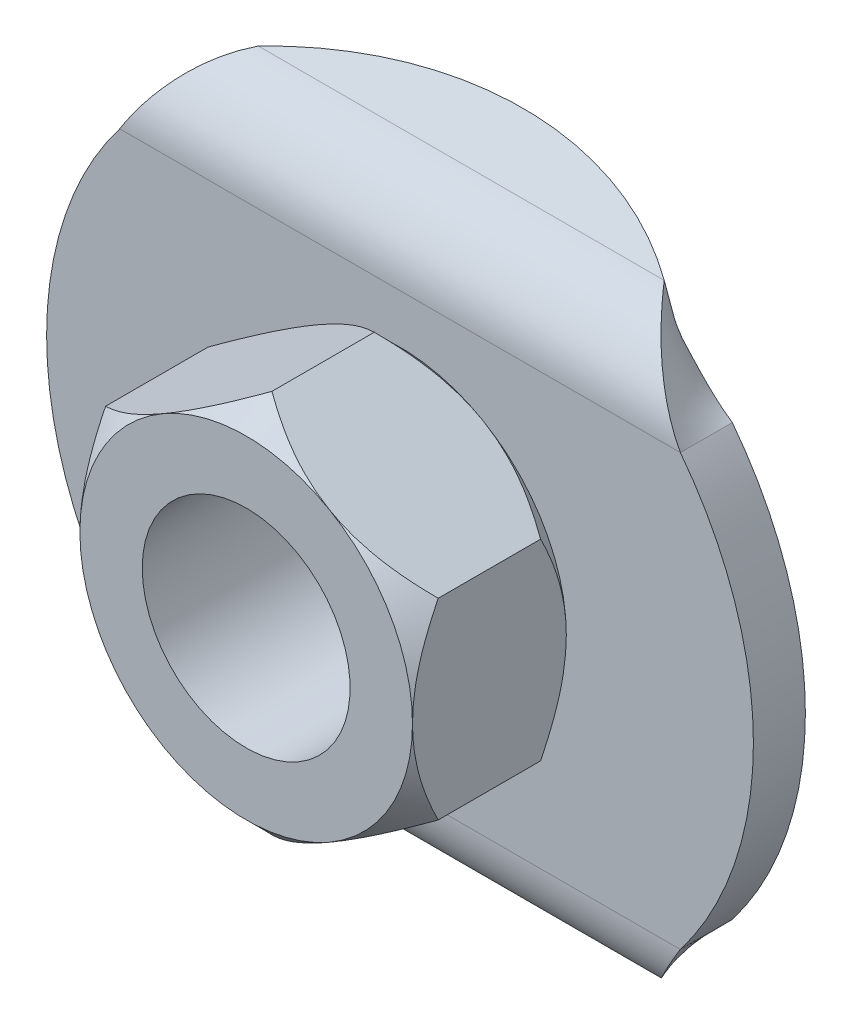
ISO-10303-21;
HEADER;
FILE_DESCRIPTION(('STEP AP214'),'2;1');
FILE_NAME('part.step','',(''),(''),'','','');
FILE_SCHEMA(('AUTOMOTIVE_DESIGN { 1 0 10303 214 1 1 1 1 }'));
ENDSEC;
DATA;
#1=APPLICATION_CONTEXT('core data for automotive mechanical design processes');
#2=APPLICATION_PROTOCOL_DEFINITION('international standard','automotive_design',2000,#1);
#3=PRODUCT_CONTEXT('',#1,'mechanical');
#4=PRODUCT('Part','Part','',(#3));
#5=PRODUCT_RELATED_PRODUCT_CATEGORY('part','',(#4));
#6=PRODUCT_DEFINITION_FORMATION('','',#4);
#7=PRODUCT_DEFINITION_CONTEXT('part definition',#1,'design');
#8=PRODUCT_DEFINITION('design','',#6,#7);
#9=PRODUCT_DEFINITION_SHAPE('','',#8);
#10=(LENGTH_UNIT() NAMED_UNIT(*) SI_UNIT(.MILLI.,.METRE.));
#11=(NAMED_UNIT(*) PLANE_ANGLE_UNIT() SI_UNIT($,.RADIAN.));
#12=(NAMED_UNIT(*) SI_UNIT($,.STERADIAN.) SOLID_ANGLE_UNIT());
#13=UNCERTAINTY_MEASURE_WITH_UNIT(LENGTH_MEASURE(1.E-05),#10,'distance_accuracy_value','');
#14=(GEOMETRIC_REPRESENTATION_CONTEXT(3) GLOBAL_UNCERTAINTY_ASSIGNED_CONTEXT((#13)) GLOBAL_UNIT_ASSIGNED_CONTEXT((#10,
#11,#12)) REPRESENTATION_CONTEXT('',''));
#15=CARTESIAN_POINT('',(0.,0.,0.));
#16=DIRECTION('',(0.,0.,1.));
#17=DIRECTION('',(1.,0.,0.));
#18=AXIS2_PLACEMENT_3D('',#15,#16,#17);
#19=CARTESIAN_POINT('',(0.,0.,4.32748503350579));
#20=DIRECTION('',(0.,0.,-1.));
#21=DIRECTION('',(1.,0.,0.));
#22=AXIS2_PLACEMENT_3D('',#19,#20,#21);
#23=CONICAL_SURFACE('',#22,4.62251496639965,0.785398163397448);
#24=CARTESIAN_POINT('',(4.00000000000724,-3.26039875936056E-13,4.94999999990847));
#25=CARTESIAN_POINT('',(4.00000000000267,0.0614356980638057,4.95000491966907));
#26=CARTESIAN_POINT('',(4.00000000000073,0.122862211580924,4.94858391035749));
#27=CARTESIAN_POINT('',(3.99999999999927,0.245576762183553,4.94293637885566));
#28=CARTESIAN_POINT('',(3.99999999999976,0.306864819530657,4.93871029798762));
#29=CARTESIAN_POINT('',(4.00000000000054,0.490128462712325,4.92191541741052));
#30=CARTESIAN_POINT('',(4.00000000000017,0.611747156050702,4.9052296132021));
#31=CARTESIAN_POINT('',(3.99999999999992,0.851296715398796,4.86208971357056));
#32=CARTESIAN_POINT('',(4.00000000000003,0.96925553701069,4.83578673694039));
#33=CARTESIAN_POINT('',(4.00000000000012,1.20293499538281,4.77455635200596));
#34=CARTESIAN_POINT('',(4.0000000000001,1.31865491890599,4.7396262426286));
#35=CARTESIAN_POINT('',(4.00000000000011,1.50790801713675,4.67579548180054));
#36=CARTESIAN_POINT('',(4.00000000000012,1.58216503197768,4.64899954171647));
#37=CARTESIAN_POINT('',(4.00000000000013,1.72959146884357,4.59260966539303));
#38=CARTESIAN_POINT('',(4.00000000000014,1.80276111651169,4.56301631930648));
#39=CARTESIAN_POINT('',(4.00000000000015,1.94879109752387,4.50102626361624));
#40=CARTESIAN_POINT('',(4.00000000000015,2.02164040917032,4.46860373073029));
#41=CARTESIAN_POINT('',(4.00000000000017,2.16629330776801,4.40151316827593));
#42=CARTESIAN_POINT('',(4.00000000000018,2.23809696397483,4.36684528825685));
#43=CARTESIAN_POINT('',(4.00000000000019,2.30940100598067,4.33119788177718));
#44=B_SPLINE_CURVE_WITH_KNOTS('',3,(#24,#25,#26,#27,#28,#29,#30,#31,#32,#33,#34,#35,#36,#37,#38,
#39,#40,#41,#42,#43),.UNSPECIFIED.,.F.,.F.,(4,2,2,2,2,2,2,2,2,4),(0.,0.18427310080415,
0.368517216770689,0.73627728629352,1.09849087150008,1.4608180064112,1.69759617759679,
1.93432450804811,2.17350066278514,2.41266090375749),.UNSPECIFIED.);
#45=CARTESIAN_POINT('',(3.9999999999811,-3.12162088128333E-13,4.94999999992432));
#46=VERTEX_POINT('',#45);
#47=CARTESIAN_POINT('',(4.00000000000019,2.30940104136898,4.33119786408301));
#48=VERTEX_POINT('',#47);
#49=EDGE_CURVE('E339',#46,#48,#44,.T.);
#50=ORIENTED_EDGE('',*,*,#49,.T.);
#51=CARTESIAN_POINT('',(3.99999999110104,2.30940104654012,4.33119782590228));
#52=CARTESIAN_POINT('',(3.9307850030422,2.34936236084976,4.37115297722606));
#53=CARTESIAN_POINT('',(3.8610347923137,2.38963267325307,4.40987412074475));
#54=CARTESIAN_POINT('',(3.72035609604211,2.47085356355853,4.48447130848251));
#55=CARTESIAN_POINT('',(3.64942695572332,2.51180451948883,4.52034570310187));
#56=CARTESIAN_POINT('',(3.43398289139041,2.63619120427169,4.62347056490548));
#57=CARTESIAN_POINT('',(3.28762938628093,2.72068844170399,4.68573980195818));
#58=CARTESIAN_POINT('',(2.99443415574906,2.88996478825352,4.79145049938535));
#59=CARTESIAN_POINT('',(2.84773023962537,2.97466433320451,4.83538655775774));
#60=CARTESIAN_POINT('',(2.62533021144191,3.10306704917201,4.88621630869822));
#61=CARTESIAN_POINT('',(2.55089902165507,3.14603991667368,4.90063866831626));
#62=CARTESIAN_POINT('',(2.4014140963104,3.23234507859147,4.92413995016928));
#63=CARTESIAN_POINT('',(2.32636055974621,3.27567725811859,4.93322051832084));
#64=CARTESIAN_POINT('',(2.20943732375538,3.34318291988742,4.94298432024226));
#65=CARTESIAN_POINT('',(2.16768271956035,3.36728995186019,4.94560636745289));
#66=CARTESIAN_POINT('',(2.08395338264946,3.41563110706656,4.94911864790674));
#67=CARTESIAN_POINT('',(2.0419784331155,3.43986535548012,4.95000198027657));
#68=CARTESIAN_POINT('',(2.00000000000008,3.46410161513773,4.9499999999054));
#69=B_SPLINE_CURVE_WITH_KNOTS('',3,(#51,#52,#53,#54,#55,#56,#57,#58,#59,#60,#61,#62,#63,#64,#65,
#66,#67,#68),.UNSPECIFIED.,.F.,.F.,(4,2,2,2,2,2,2,2,4),(0.,0.268044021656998,0.536242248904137,
1.07581329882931,1.5997027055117,1.86100635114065,2.12222944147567,2.26705748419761,
2.41245919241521),.UNSPECIFIED.);
#70=CARTESIAN_POINT('',(1.99999999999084,3.46410161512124,4.94999999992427));
#71=VERTEX_POINT('',#70);
#72=EDGE_CURVE('E332',#48,#71,#69,.T.);
#73=ORIENTED_EDGE('',*,*,#72,.T.);
#74=CARTESIAN_POINT('',(0.,0.,4.94999999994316));
#75=DIRECTION('',(0.,0.,-1.));
#76=DIRECTION('',(1.,0.,0.));
#77=AXIS2_PLACEMENT_3D('',#74,#75,#76);
#78=CIRCLE('',#77,3.99999999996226);
#79=EDGE_CURVE('E277',#71,#46,#78,.T.);
#80=ORIENTED_EDGE('',*,*,#79,.T.);
#81=EDGE_LOOP('',(#50,#73,#80));
#82=FACE_BOUND('',#81,.T.);
#83=ADVANCED_FACE('F14',(#82),#23,.T.);
#84=CARTESIAN_POINT('',(0.,0.,4.32748503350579));
#85=DIRECTION('',(0.,0.,-1.));
#86=DIRECTION('',(1.,0.,0.));
#87=AXIS2_PLACEMENT_3D('',#84,#85,#86);
#88=CONICAL_SURFACE('',#87,4.62251496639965,0.785398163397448);
#89=CARTESIAN_POINT('',(2.00000000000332,-3.46410161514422,4.94999999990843));
#90=CARTESIAN_POINT('',(2.05320487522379,-3.43338376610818,4.95000491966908));
#91=CARTESIAN_POINT('',(2.10640179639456,-3.40267050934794,4.94858391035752));
#92=CARTESIAN_POINT('',(2.2126757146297,-3.34131323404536,4.94293637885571));
#93=CARTESIAN_POINT('',(2.26575272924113,-3.31066920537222,4.93871029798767));
#94=CARTESIAN_POINT('',(2.42446369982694,-3.21903738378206,4.92191541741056));
#95=CARTESIAN_POINT('',(2.52978857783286,-3.15822803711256,4.90522961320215));
#96=CARTESIAN_POINT('',(2.73724458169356,-3.03845325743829,4.8620897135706));
#97=CARTESIAN_POINT('',(2.83939991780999,-2.97947384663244,4.83578673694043));
#98=CARTESIAN_POINT('',(3.04177226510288,-2.86263411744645,4.77455635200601));
#99=CARTESIAN_POINT('',(3.14198865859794,-2.80477415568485,4.73962624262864));
#100=CARTESIAN_POINT('',(3.3058866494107,-2.71014760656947,4.67579548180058));
#101=CARTESIAN_POINT('',(3.37019511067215,-2.67301909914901,4.64899954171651));
#102=CARTESIAN_POINT('',(3.49787015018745,-2.59930588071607,4.59260966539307));
#103=CARTESIAN_POINT('',(3.56123692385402,-2.56272105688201,4.56301631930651));
#104=CARTESIAN_POINT('',(3.68770259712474,-2.48970606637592,4.50102626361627));
#105=CARTESIAN_POINT('',(3.75079195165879,-2.45328141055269,4.46860373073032));
#106=CARTESIAN_POINT('',(3.87606503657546,-2.38095496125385,4.40151316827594));
#107=CARTESIAN_POINT('',(3.93824882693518,-2.34505313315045,4.36684528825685));
#108=CARTESIAN_POINT('',(3.99999993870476,-2.30940111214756,4.33119788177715));
#109=B_SPLINE_CURVE_WITH_KNOTS('',3,(#89,#90,#91,#92,#93,#94,#95,#96,#97,#98,#99,#100,#101,#102,
#103,#104,#105,#106,#107,#108),.UNSPECIFIED.,.F.,.F.,(4,2,2,2,2,2,2,2,2,4),(0.,
0.184273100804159,0.368517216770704,0.736277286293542,1.09849087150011,1.46081800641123,
1.69759617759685,1.93432450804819,2.17350066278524,2.41266090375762),.UNSPECIFIED.);
#110=CARTESIAN_POINT('',(1.99999999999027,-3.46410161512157,4.9499999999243));
#111=VERTEX_POINT('',#110);
#112=CARTESIAN_POINT('',(3.99999996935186,-2.30940109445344,4.33119786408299));
#113=VERTEX_POINT('',#112);
#114=EDGE_CURVE('E303',#111,#113,#109,.T.);
#115=ORIENTED_EDGE('',*,*,#114,.T.);
#116=CARTESIAN_POINT('',(3.99999996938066,-2.30940108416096,4.33119782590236));
#117=CARTESIAN_POINT('',(3.99999998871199,-2.22947848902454,4.37115297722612));
#118=CARTESIAN_POINT('',(3.99999999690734,-2.14893787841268,4.40987412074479));
#119=CARTESIAN_POINT('',(4.00000000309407,-1.98649610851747,4.48447130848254));
#120=CARTESIAN_POINT('',(4.00000000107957,-1.90459419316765,4.52034570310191));
#121=CARTESIAN_POINT('',(3.9999999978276,-1.65582081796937,4.62347056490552));
#122=CARTESIAN_POINT('',(3.99999999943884,-1.48682634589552,4.68573980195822));
#123=CARTESIAN_POINT('',(4.00000000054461,-1.14827365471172,4.79145049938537));
#124=CARTESIAN_POINT('',(4.00000000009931,-0.978874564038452,4.83538655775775));
#125=CARTESIAN_POINT('',(3.99999999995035,-0.722069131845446,4.88621630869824));
#126=CARTESIAN_POINT('',(3.99999999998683,-0.636123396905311,4.9006386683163));
#127=CARTESIAN_POINT('',(4.00000000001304,-0.463513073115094,4.92413995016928));
#128=CARTESIAN_POINT('',(4.00000000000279,-0.376848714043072,4.9332205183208));
#129=CARTESIAN_POINT('',(3.99999999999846,-0.241837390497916,4.94298432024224));
#130=CARTESIAN_POINT('',(3.99999999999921,-0.193623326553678,4.9456063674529));
#131=CARTESIAN_POINT('',(4.00000000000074,-0.096941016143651,4.94911864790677));
#132=CARTESIAN_POINT('',(4.00000000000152,-0.0484725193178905,4.95000198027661));
#133=CARTESIAN_POINT('',(4.,0.,4.94999999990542));
#134=B_SPLINE_CURVE_WITH_KNOTS('',3,(#116,#117,#118,#119,#120,#121,#122,#123,#124,#125,#126,
#127,#128,#129,#130,#131,#132,#133),.UNSPECIFIED.,.F.,.F.,(4,2,2,2,2,2,2,2,4),(0.,
0.268044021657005,0.536242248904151,1.07581329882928,1.59970270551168,1.86100635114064,
2.12222944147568,2.2670574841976,2.41245919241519),.UNSPECIFIED.);
#135=EDGE_CURVE('E295',#113,#46,#134,.T.);
#136=ORIENTED_EDGE('',*,*,#135,.T.);
#137=CARTESIAN_POINT('',(0.,0.,4.94999999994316));
#138=DIRECTION('',(0.,0.,-1.));
#139=DIRECTION('',(1.,0.,0.));
#140=AXIS2_PLACEMENT_3D('',#137,#138,#139);
#141=CIRCLE('',#140,3.99999999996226);
#142=EDGE_CURVE('E246',#46,#111,#141,.T.);
#143=ORIENTED_EDGE('',*,*,#142,.T.);
#144=EDGE_LOOP('',(#115,#136,#143));
#145=FACE_BOUND('',#144,.T.);
#146=ADVANCED_FACE('F313',(#145),#88,.T.);
#147=CARTESIAN_POINT('',(0.,0.,4.32748503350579));
#148=DIRECTION('',(0.,0.,-1.));
#149=DIRECTION('',(1.,0.,0.));
#150=AXIS2_PLACEMENT_3D('',#147,#148,#149);
#151=CONICAL_SURFACE('',#150,4.62251496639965,0.785398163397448);
#152=CARTESIAN_POINT('',(-4.00000000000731,3.26039875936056E-13,4.94999999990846));
#153=CARTESIAN_POINT('',(-4.0000000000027,-0.0614356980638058,4.95000491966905));
#154=CARTESIAN_POINT('',(-4.00000000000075,-0.122862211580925,4.94858391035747));
#155=CARTESIAN_POINT('',(-3.99999999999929,-0.245576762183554,4.94293637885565));
#156=CARTESIAN_POINT('',(-3.99999999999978,-0.306864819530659,4.93871029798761));
#157=CARTESIAN_POINT('',(-4.00000000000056,-0.490128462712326,4.92191541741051));
#158=CARTESIAN_POINT('',(-4.00000000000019,-0.611747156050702,4.9052296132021));
#159=CARTESIAN_POINT('',(-3.99999999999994,-0.851296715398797,4.86208971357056));
#160=CARTESIAN_POINT('',(-4.00000000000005,-0.969255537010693,4.8357867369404));
#161=CARTESIAN_POINT('',(-4.00000000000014,-1.20293499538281,4.77455635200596));
#162=CARTESIAN_POINT('',(-4.00000000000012,-1.31865491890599,4.73962624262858));
#163=CARTESIAN_POINT('',(-4.00000000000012,-1.50790801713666,4.67579548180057));
#164=CARTESIAN_POINT('',(-4.00000000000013,-1.58216503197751,4.64899954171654));
#165=CARTESIAN_POINT('',(-4.00000000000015,-1.72959146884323,4.59260966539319));
#166=CARTESIAN_POINT('',(-4.00000000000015,-1.80276111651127,4.56301631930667));
#167=CARTESIAN_POINT('',(-4.00000000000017,-1.94879109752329,4.50102626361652));
#168=CARTESIAN_POINT('',(-4.00000000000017,-2.02164040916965,4.46860373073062));
#169=CARTESIAN_POINT('',(-4.00000000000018,-2.16629330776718,4.40151316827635));
#170=CARTESIAN_POINT('',(-4.00000000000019,-2.23809696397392,4.36684528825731));
#171=CARTESIAN_POINT('',(-4.0000000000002,-2.30940100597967,4.33119788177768));
#172=B_SPLINE_CURVE_WITH_KNOTS('',3,(#152,#153,#154,#155,#156,#157,#158,#159,#160,#161,#162,
#163,#164,#165,#166,#167,#168,#169,#170,#171),.UNSPECIFIED.,.F.,.F.,(4,2,2,2,2,2,2,2,2,4),(0.,
0.184273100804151,0.36851721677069,0.736277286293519,1.09849087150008,1.4608180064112,
1.69759617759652,1.93432450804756,2.1735006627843,2.41266090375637),.UNSPECIFIED.);
#173=CARTESIAN_POINT('',(-3.99999999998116,3.53795451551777E-13,4.94999999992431));
#174=VERTEX_POINT('',#173);
#175=CARTESIAN_POINT('',(-4.0000000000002,-2.30940104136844,4.33119786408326));
#176=VERTEX_POINT('',#175);
#177=EDGE_CURVE('E896',#174,#176,#172,.T.);
#178=ORIENTED_EDGE('',*,*,#177,.T.);
#179=CARTESIAN_POINT('',(-3.99999999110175,-2.30940104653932,4.33119782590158));
#180=CARTESIAN_POINT('',(-3.93078500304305,-2.34936236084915,4.3711529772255));
#181=CARTESIAN_POINT('',(-3.86103479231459,-2.38963267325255,4.40987412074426));
#182=CARTESIAN_POINT('',(-3.72035609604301,-2.4708535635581,4.4844713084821));
#183=CARTESIAN_POINT('',(-3.64942695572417,-2.5118045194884,4.52034570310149));
#184=CARTESIAN_POINT('',(-3.43398289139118,-2.63619120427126,4.62347056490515));
#185=CARTESIAN_POINT('',(-3.28762938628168,-2.7206884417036,4.68573980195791));
#186=CARTESIAN_POINT('',(-2.99443415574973,-2.88996478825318,4.79145049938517));
#187=CARTESIAN_POINT('',(-2.847730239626,-2.97466433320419,4.83538655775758));
#188=CARTESIAN_POINT('',(-2.62533021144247,-3.10306704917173,4.88621630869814));
#189=CARTESIAN_POINT('',(-2.55089902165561,-3.14603991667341,4.90063866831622));
#190=CARTESIAN_POINT('',(-2.40141409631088,-3.23234507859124,4.92413995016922));
#191=CARTESIAN_POINT('',(-2.32636055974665,-3.27567725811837,4.93322051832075));
#192=CARTESIAN_POINT('',(-2.20943732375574,-3.34318291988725,4.94298432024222));
#193=CARTESIAN_POINT('',(-2.16768271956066,-3.36728995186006,4.94560636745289));
#194=CARTESIAN_POINT('',(-2.08395338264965,-3.41563110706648,4.94911864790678));
#195=CARTESIAN_POINT('',(-2.04197843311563,-3.43986535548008,4.95000198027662));
#196=CARTESIAN_POINT('',(-2.00000000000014,-3.4641016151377,4.94999999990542));
#197=B_SPLINE_CURVE_WITH_KNOTS('',3,(#179,#180,#181,#182,#183,#184,#185,#186,#187,#188,#189,
#190,#191,#192,#193,#194,#195,#196),.UNSPECIFIED.,.F.,.F.,(4,2,2,2,2,2,2,2,4),(0.,
0.268044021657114,0.536242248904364,1.07581329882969,1.59970270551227,1.86100635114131,
2.12222944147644,2.26705748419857,2.41245919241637),.UNSPECIFIED.);
#198=CARTESIAN_POINT('',(-1.99999999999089,-3.46410161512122,4.94999999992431));
#199=VERTEX_POINT('',#198);
#200=EDGE_CURVE('E889',#176,#199,#197,.T.);
#201=ORIENTED_EDGE('',*,*,#200,.T.);
#202=CARTESIAN_POINT('',(0.,0.,4.94999999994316));
#203=DIRECTION('',(0.,0.,-1.));
#204=DIRECTION('',(1.,0.,0.));
#205=AXIS2_PLACEMENT_3D('',#202,#203,#204);
#206=CIRCLE('',#205,3.99999999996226);
#207=EDGE_CURVE('E286',#199,#174,#206,.T.);
#208=ORIENTED_EDGE('',*,*,#207,.T.);
#209=EDGE_LOOP('',(#178,#201,#208));
#210=FACE_BOUND('',#209,.T.);
#211=ADVANCED_FACE('F318',(#210),#151,.T.);
#212=CARTESIAN_POINT('',(0.,0.,4.32748503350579));
#213=DIRECTION('',(0.,0.,-1.));
#214=DIRECTION('',(1.,0.,0.));
#215=AXIS2_PLACEMENT_3D('',#212,#213,#214);
#216=CONICAL_SURFACE('',#215,4.62251496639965,0.785398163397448);
#217=CARTESIAN_POINT('',(-2.00000000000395,-3.46410161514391,4.94999999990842));
#218=CARTESIAN_POINT('',(-1.94679512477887,-3.49481946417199,4.95000491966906));
#219=CARTESIAN_POINT('',(-1.89359820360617,-3.52553272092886,4.9485839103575));
#220=CARTESIAN_POINT('',(-1.78732428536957,-3.58688999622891,4.94293637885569));
#221=CARTESIAN_POINT('',(-1.73424727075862,-3.61753402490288,4.93871029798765));
#222=CARTESIAN_POINT('',(-1.57553630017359,-3.7091658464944,4.92191541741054));
#223=CARTESIAN_POINT('',(-1.47021142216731,-3.76997519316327,4.90522961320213));
#224=CARTESIAN_POINT('',(-1.26275541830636,-3.8897499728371,4.86208971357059));
#225=CARTESIAN_POINT('',(-1.16060008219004,-3.94872938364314,4.83578673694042));
#226=CARTESIAN_POINT('',(-0.958227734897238,-4.06556911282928,4.774556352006));
#227=CARTESIAN_POINT('',(-0.858011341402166,-4.12342907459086,4.73962624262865));
#228=CARTESIAN_POINT('',(-0.694113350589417,-4.21805562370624,4.67579548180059));
#229=CARTESIAN_POINT('',(-0.629804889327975,-4.25518413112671,4.64899954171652));
#230=CARTESIAN_POINT('',(-0.502129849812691,-4.32889734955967,4.59260966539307));
#231=CARTESIAN_POINT('',(-0.438763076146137,-4.36548217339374,4.56301631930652));
#232=CARTESIAN_POINT('',(-0.312297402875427,-4.43849716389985,4.50102626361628));
#233=CARTESIAN_POINT('',(-0.249208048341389,-4.47492181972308,4.46860373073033));
#234=CARTESIAN_POINT('',(-0.123934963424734,-4.54724826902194,4.40151316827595));
#235=CARTESIAN_POINT('',(-0.0617511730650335,-4.58315009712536,4.36684528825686));
#236=CARTESIAN_POINT('',(-6.12954837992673E-08,-4.61880211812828,4.33119788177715));
#237=B_SPLINE_CURVE_WITH_KNOTS('',3,(#217,#218,#219,#220,#221,#222,#223,#224,#225,#226,#227,
#228,#229,#230,#231,#232,#233,#234,#235,#236),.UNSPECIFIED.,.F.,.F.,(4,2,2,2,2,2,2,2,2,4),(0.,
0.184273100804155,0.368517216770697,0.736277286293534,1.09849087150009,1.46081800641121,
1.69759617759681,1.93432450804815,2.17350066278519,2.41266090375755),.UNSPECIFIED.);
#238=CARTESIAN_POINT('',(-3.0648335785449E-08,-4.61880213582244,4.33119786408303));
#239=VERTEX_POINT('',#238);
#240=EDGE_CURVE('E408',#199,#239,#237,.T.);
#241=ORIENTED_EDGE('',*,*,#240,.T.);
#242=CARTESIAN_POINT('',(-2.17203836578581E-08,-4.61880213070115,4.33119782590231));
#243=CARTESIAN_POINT('',(0.0692149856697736,-4.57884084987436,4.3711529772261));
#244=CARTESIAN_POINT('',(0.138965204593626,-4.5385705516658,4.40987412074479));
#245=CARTESIAN_POINT('',(0.279643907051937,-4.45734967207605,4.48447130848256));
#246=CARTESIAN_POINT('',(0.350573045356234,-4.41639871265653,4.52034570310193));
#247=CARTESIAN_POINT('',(0.56601710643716,-4.29201202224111,4.62347056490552));
#248=CARTESIAN_POINT('',(0.712370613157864,-4.20751478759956,4.68573980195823));
#249=CARTESIAN_POINT('',(1.00556584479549,-4.0382384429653,4.79145049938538));
#250=CARTESIAN_POINT('',(1.15226976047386,-3.95353889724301,4.83538655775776));
#251=CARTESIAN_POINT('',(1.37466978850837,-3.82513618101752,4.88621630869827));
#252=CARTESIAN_POINT('',(1.44910097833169,-3.78216331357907,4.90063866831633));
#253=CARTESIAN_POINT('',(1.59858590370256,-3.69585815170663,4.9241399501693));
#254=CARTESIAN_POINT('',(1.67363944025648,-3.65252597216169,4.9332205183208));
#255=CARTESIAN_POINT('',(1.790562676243,-3.58502031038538,4.94298432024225));
#256=CARTESIAN_POINT('',(1.83231728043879,-3.56091327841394,4.94560636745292));
#257=CARTESIAN_POINT('',(1.91604661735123,-3.51257212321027,4.94911864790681));
#258=CARTESIAN_POINT('',(1.95802156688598,-3.48833787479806,4.95000198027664));
#259=CARTESIAN_POINT('',(1.99999999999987,-3.46410161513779,4.94999999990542));
#260=B_SPLINE_CURVE_WITH_KNOTS('',3,(#242,#243,#244,#245,#246,#247,#248,#249,#250,#251,#252,
#253,#254,#255,#256,#257,#258,#259),.UNSPECIFIED.,.F.,.F.,(4,2,2,2,2,2,2,2,4),(0.,
0.268044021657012,0.53624224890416,1.07581329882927,1.59970270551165,1.8610063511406,
2.12222944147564,2.26705748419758,2.41245919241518),.UNSPECIFIED.);
#261=EDGE_CURVE('E901',#239,#111,#260,.T.);
#262=ORIENTED_EDGE('',*,*,#261,.T.);
#263=CARTESIAN_POINT('',(0.,0.,4.94999999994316));
#264=DIRECTION('',(0.,0.,-1.));
#265=DIRECTION('',(1.,0.,0.));
#266=AXIS2_PLACEMENT_3D('',#263,#264,#265);
#267=CIRCLE('',#266,3.99999999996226);
#268=EDGE_CURVE('E289',#111,#199,#267,.T.);
#269=ORIENTED_EDGE('',*,*,#268,.T.);
#270=EDGE_LOOP('',(#241,#262,#269));
#271=FACE_BOUND('',#270,.T.);
#272=ADVANCED_FACE('F783',(#271),#216,.T.);
#273=CARTESIAN_POINT('',(0.,0.,4.32748503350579));
#274=DIRECTION('',(0.,0.,-1.));
#275=DIRECTION('',(1.,0.,0.));
#276=AXIS2_PLACEMENT_3D('',#273,#274,#275);
#277=CONICAL_SURFACE('',#276,4.62251496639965,0.785398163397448);
#278=CARTESIAN_POINT('',(0.,0.,4.94999999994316));
#279=DIRECTION('',(0.,0.,-1.));
#280=DIRECTION('',(1.,0.,0.));
#281=AXIS2_PLACEMENT_3D('',#278,#279,#280);
#282=CIRCLE('',#281,3.99999999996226);
#283=CARTESIAN_POINT('',(-1.99999999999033,3.46410161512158,4.94999999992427));
#284=VERTEX_POINT('',#283);
#285=EDGE_CURVE('E280',#284,#71,#282,.T.);
#286=ORIENTED_EDGE('',*,*,#285,.T.);
#287=CARTESIAN_POINT('',(2.00000000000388,3.46410161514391,4.94999999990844));
#288=CARTESIAN_POINT('',(1.94679512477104,3.49481946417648,4.95000491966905));
#289=CARTESIAN_POINT('',(1.89359820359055,3.52553272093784,4.94858391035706));
#290=CARTESIAN_POINT('',(1.78732428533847,3.58688999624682,4.94293637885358));
#291=CARTESIAN_POINT('',(1.73424727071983,3.61753402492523,4.93871029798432));
#292=CARTESIAN_POINT('',(1.57553630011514,3.70916584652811,4.92191541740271));
#293=CARTESIAN_POINT('',(1.47021142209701,3.76997519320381,4.9052296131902));
#294=CARTESIAN_POINT('',(1.26275541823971,3.88974997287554,4.862089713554));
#295=CARTESIAN_POINT('',(1.16060008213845,3.94872938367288,4.83578673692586));
#296=CARTESIAN_POINT('',(0.9582277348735,4.06556911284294,4.77455635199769));
#297=CARTESIAN_POINT('',(0.858011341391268,4.12342907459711,4.73962624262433));
#298=CARTESIAN_POINT('',(0.694113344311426,4.21805562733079,4.67579547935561));
#299=CARTESIAN_POINT('',(0.629804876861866,4.25518413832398,4.64899953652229));
#300=CARTESIAN_POINT('',(0.502129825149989,4.32889736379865,4.59260965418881));
#301=CARTESIAN_POINT('',(0.438763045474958,4.36548219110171,4.56301630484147));
#302=CARTESIAN_POINT('',(0.312297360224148,4.43849718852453,4.50102624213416));
#303=CARTESIAN_POINT('',(0.249207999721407,4.47492184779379,4.46860370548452));
#304=CARTESIAN_POINT('',(0.123934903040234,4.54724830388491,4.40151313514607));
#305=CARTESIAN_POINT('',(0.0617511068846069,4.5831501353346,4.36684525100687));
#306=CARTESIAN_POINT('',(-1.06050295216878E-08,4.61880215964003,4.33119784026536));
#307=B_SPLINE_CURVE_WITH_KNOTS('',3,(#287,#288,#289,#290,#291,#292,#293,#294,#295,#296,#297,
#298,#299,#300,#301,#302,#303,#304,#305,#306),.UNSPECIFIED.,.F.,.F.,(4,2,2,2,2,2,2,2,2,4),(0.,
0.184273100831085,0.368517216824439,0.736277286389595,1.09849087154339,1.46081800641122,
1.69759620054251,1.93432455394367,2.17350073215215,2.41266099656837),.UNSPECIFIED.);
#308=CARTESIAN_POINT('',(-6.11192918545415E-09,4.61880215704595,4.33119784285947));
#309=VERTEX_POINT('',#308);
#310=EDGE_CURVE('E346',#71,#309,#307,.T.);
#311=ORIENTED_EDGE('',*,*,#310,.T.);
#312=CARTESIAN_POINT('',(-6.12995787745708E-08,4.61880211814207,4.33119788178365));
#313=CARTESIAN_POINT('',(-0.069215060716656,4.57884081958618,4.37115302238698));
#314=CARTESIAN_POINT('',(-0.138965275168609,4.53857051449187,4.4098741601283));
#315=CARTESIAN_POINT('',(-0.279643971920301,4.45734963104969,4.48447134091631));
#316=CARTESIAN_POINT('',(-0.350573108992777,4.41639867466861,4.52034573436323));
#317=CARTESIAN_POINT('',(-0.566017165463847,4.29201199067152,4.62347059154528));
#318=CARTESIAN_POINT('',(-0.712370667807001,4.207514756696,4.68573982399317));
#319=CARTESIAN_POINT('',(-1.00556589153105,4.03823841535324,4.79145051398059));
#320=CARTESIAN_POINT('',(-1.15226980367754,3.95353887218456,4.83538656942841));
#321=CARTESIAN_POINT('',(-1.37466982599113,3.82513615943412,4.88621631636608));
#322=CARTESIAN_POINT('',(-1.44910101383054,3.78216329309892,4.90063867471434));
#323=CARTESIAN_POINT('',(-1.59858593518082,3.69585813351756,4.92413995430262));
#324=CARTESIAN_POINT('',(-1.67363946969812,3.6525259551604,4.93322052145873));
#325=CARTESIAN_POINT('',(-1.79056269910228,3.5850202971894,4.94298432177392));
#326=CARTESIAN_POINT('',(-1.8323172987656,3.56091326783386,4.94560636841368));
#327=CARTESIAN_POINT('',(-1.91604662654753,3.51257211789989,4.94911864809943));
#328=CARTESIAN_POINT('',(-1.95802157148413,3.48833787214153,4.95000198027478));
#329=CARTESIAN_POINT('',(-1.99999999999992,3.4641016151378,4.9499999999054));
#330=B_SPLINE_CURVE_WITH_KNOTS('',3,(#312,#313,#314,#315,#316,#317,#318,#319,#320,#321,#322,
#323,#324,#325,#326,#327,#328,#329),.UNSPECIFIED.,.F.,.F.,(4,2,2,2,2,2,2,2,4),(0.,
0.268044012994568,0.536242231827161,1.07581326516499,1.59970265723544,1.86100629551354,
2.12222937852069,2.26705740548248,2.41245909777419),.UNSPECIFIED.);
#331=EDGE_CURVE('E353',#309,#284,#330,.T.);
#332=ORIENTED_EDGE('',*,*,#331,.T.);
#333=EDGE_LOOP('',(#286,#311,#332));
#334=FACE_BOUND('',#333,.T.);
#335=ADVANCED_FACE('F328',(#334),#277,.T.);
#336=CARTESIAN_POINT('',(0.,0.,4.32748503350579));
#337=DIRECTION('',(0.,0.,-1.));
#338=DIRECTION('',(1.,0.,0.));
#339=AXIS2_PLACEMENT_3D('',#336,#337,#338);
#340=CONICAL_SURFACE('',#339,4.62251496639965,0.785398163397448);
#341=CARTESIAN_POINT('',(-2.00000000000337,3.46410161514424,4.94999999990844));
#342=CARTESIAN_POINT('',(-2.05320487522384,3.43338376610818,4.95000491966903));
#343=CARTESIAN_POINT('',(-2.1064017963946,3.40267050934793,4.94858391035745));
#344=CARTESIAN_POINT('',(-2.21267571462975,3.34131323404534,4.94293637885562));
#345=CARTESIAN_POINT('',(-2.26575272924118,3.31066920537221,4.93871029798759));
#346=CARTESIAN_POINT('',(-2.424463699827,3.21903738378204,4.92191541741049));
#347=CARTESIAN_POINT('',(-2.52978857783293,3.15822803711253,4.90522961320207));
#348=CARTESIAN_POINT('',(-2.73724458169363,3.03845325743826,4.86208971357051));
#349=CARTESIAN_POINT('',(-2.83939991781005,2.97947384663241,4.83578673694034));
#350=CARTESIAN_POINT('',(-3.04177226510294,2.86263411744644,4.77455635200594));
#351=CARTESIAN_POINT('',(-3.14198865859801,2.80477415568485,4.73962624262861));
#352=CARTESIAN_POINT('',(-3.30588664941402,2.71014760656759,4.67579548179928));
#353=CARTESIAN_POINT('',(-3.37019511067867,2.67301909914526,4.64899954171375));
#354=CARTESIAN_POINT('',(-3.49787015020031,2.59930588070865,4.59260966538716));
#355=CARTESIAN_POINT('',(-3.56123692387,2.56272105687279,4.56301631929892));
#356=CARTESIAN_POINT('',(-3.68770259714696,2.48970606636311,4.50102626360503));
#357=CARTESIAN_POINT('',(-3.75079195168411,2.45328141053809,4.46860373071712));
#358=CARTESIAN_POINT('',(-3.8760650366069,2.38095496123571,4.40151316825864));
#359=CARTESIAN_POINT('',(-3.93824882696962,2.34505313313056,4.36684528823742));
#360=CARTESIAN_POINT('',(-3.99999993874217,2.30940111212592,4.33119788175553));
#361=B_SPLINE_CURVE_WITH_KNOTS('',3,(#341,#342,#343,#344,#345,#346,#347,#348,#349,#350,#351,
#352,#353,#354,#355,#356,#357,#358,#359,#360),.UNSPECIFIED.,.F.,.F.,(4,2,2,2,2,2,2,2,2,4),(0.,
0.184273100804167,0.368517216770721,0.736277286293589,1.09849087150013,1.46081800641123,
1.69759617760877,1.93432450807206,2.17350066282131,2.41266090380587),.UNSPECIFIED.);
#362=CARTESIAN_POINT('',(-3.99999996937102,2.30940109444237,4.33119786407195));
#363=VERTEX_POINT('',#362);
#364=EDGE_CURVE('E929',#284,#363,#361,.T.);
#365=ORIENTED_EDGE('',*,*,#364,.T.);
#366=CARTESIAN_POINT('',(-3.99999996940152,2.30940108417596,4.33119782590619));
#367=CARTESIAN_POINT('',(-3.9999999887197,2.22947848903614,4.3711529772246));
#368=CARTESIAN_POINT('',(-3.99999999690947,2.14893787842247,4.40987412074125));
#369=CARTESIAN_POINT('',(-4.00000000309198,1.98649610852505,4.484471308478));
#370=CARTESIAN_POINT('',(-4.00000000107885,1.90459419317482,4.5203457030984));
#371=CARTESIAN_POINT('',(-3.9999999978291,1.6558208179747,4.62347056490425));
#372=CARTESIAN_POINT('',(-3.99999999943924,1.48682634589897,4.68573980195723));
#373=CARTESIAN_POINT('',(-4.00000000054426,1.14827365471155,4.79145049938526));
#374=CARTESIAN_POINT('',(-4.00000000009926,0.978874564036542,4.83538655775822));
#375=CARTESIAN_POINT('',(-3.99999999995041,0.722069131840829,4.88621630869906));
#376=CARTESIAN_POINT('',(-3.99999999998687,0.636123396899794,4.90063866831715));
#377=CARTESIAN_POINT('',(-4.00000000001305,0.463513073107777,4.92413995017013));
#378=CARTESIAN_POINT('',(-4.00000000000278,0.376848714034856,4.93322051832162));
#379=CARTESIAN_POINT('',(-3.99999999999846,0.24183739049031,4.94298432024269));
#380=CARTESIAN_POINT('',(-3.99999999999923,0.193623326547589,4.94560636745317));
#381=CARTESIAN_POINT('',(-4.00000000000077,0.0969410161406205,4.94911864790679));
#382=CARTESIAN_POINT('',(-4.00000000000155,0.0484725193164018,4.95000198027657));
#383=CARTESIAN_POINT('',(-4.,1.31750846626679E-13,4.94999999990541));
#384=B_SPLINE_CURVE_WITH_KNOTS('',3,(#366,#367,#368,#369,#370,#371,#372,#373,#374,#375,#376,
#377,#378,#379,#380,#381,#382,#383),.UNSPECIFIED.,.F.,.F.,(4,2,2,2,2,2,2,2,4),(0.,
0.268044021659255,0.536242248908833,1.07581329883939,1.59970270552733,1.86100635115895,
2.12222944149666,2.26705748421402,2.41245919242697),.UNSPECIFIED.);
#385=EDGE_CURVE('E930',#363,#174,#384,.T.);
#386=ORIENTED_EDGE('',*,*,#385,.T.);
#387=CARTESIAN_POINT('',(0.,0.,4.94999999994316));
#388=DIRECTION('',(0.,0.,-1.));
#389=DIRECTION('',(1.,0.,0.));
#390=AXIS2_PLACEMENT_3D('',#387,#388,#389);
#391=CIRCLE('',#390,3.99999999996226);
#392=EDGE_CURVE('E283',#174,#284,#391,.T.);
#393=ORIENTED_EDGE('',*,*,#392,.T.);
#394=EDGE_LOOP('',(#365,#386,#393));
#395=FACE_BOUND('',#394,.T.);
#396=ADVANCED_FACE('F770',(#395),#340,.T.);
#397=CARTESIAN_POINT('',(4.00000000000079,9.64650771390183,1.24999999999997));
#398=DIRECTION('',(-1.,0.,0.));
#399=DIRECTION('',(0.,1.,0.));
#400=AXIS2_PLACEMENT_3D('',#397,#398,#399);
#401=PLANE('',#400);
#402=DIRECTION('',(0.,0.,-1.));
#403=VECTOR('',#402,1.);
#404=CARTESIAN_POINT('',(4.00000000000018,2.30940107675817,1.25000000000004));
#405=LINE('',#404,#403);
#406=CARTESIAN_POINT('',(3.99999999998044,2.30940107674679,1.86880215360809));
#407=VERTEX_POINT('',#406);
#408=EDGE_CURVE('E247',#48,#407,#405,.T.);
#409=ORIENTED_EDGE('',*,*,#408,.F.);
#410=ORIENTED_EDGE('',*,*,#49,.F.);
#411=ORIENTED_EDGE('',*,*,#135,.F.);
#412=DIRECTION('',(0.,0.,-1.));
#413=VECTOR('',#412,1.);
#414=CARTESIAN_POINT('',(3.99999999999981,-2.30940107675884,1.25000000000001));
#415=LINE('',#414,#413);
#416=CARTESIAN_POINT('',(3.99999999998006,-2.30940107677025,1.86880215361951));
#417=VERTEX_POINT('',#416);
#418=EDGE_CURVE('E251',#417,#113,#415,.F.);
#419=ORIENTED_EDGE('',*,*,#418,.F.);
#420=CARTESIAN_POINT('',(4.00000000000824,-3.53795451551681E-13,1.25000000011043));
#421=CARTESIAN_POINT('',(4.00000000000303,-0.0614356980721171,1.24999508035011));
#422=CARTESIAN_POINT('',(4.00000000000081,-0.122862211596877,1.25141608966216));
#423=CARTESIAN_POINT('',(3.99999999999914,-0.245576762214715,1.25706362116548));
#424=CARTESIAN_POINT('',(3.99999999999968,-0.306864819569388,1.26128970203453));
#425=CARTESIAN_POINT('',(4.00000000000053,-0.490128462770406,1.27808458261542));
#426=CARTESIAN_POINT('',(4.0000000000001,-0.611747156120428,1.29477038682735));
#427=CARTESIAN_POINT('',(3.99999999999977,-0.851296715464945,1.33791028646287));
#428=CARTESIAN_POINT('',(3.99999999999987,-0.969255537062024,1.36421326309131));
#429=CARTESIAN_POINT('',(3.99999999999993,-1.20293499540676,1.42544364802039));
#430=CARTESIAN_POINT('',(3.99999999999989,-1.31865491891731,1.46037375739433));
#431=CARTESIAN_POINT('',(3.99999999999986,-1.50790802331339,1.52420452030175));
#432=CARTESIAN_POINT('',(3.99999999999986,-1.58216504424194,1.55100046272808));
#433=CARTESIAN_POINT('',(3.99999999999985,-1.72959149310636,1.60739034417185));
#434=CARTESIAN_POINT('',(3.99999999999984,-1.80276114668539,1.63698369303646));
#435=CARTESIAN_POINT('',(3.99999999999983,-1.94879113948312,1.69897375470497));
#436=CARTESIAN_POINT('',(3.99999999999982,-2.02164045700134,1.73139629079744));
#437=CARTESIAN_POINT('',(3.99999999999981,-2.16629336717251,1.79848685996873));
#438=CARTESIAN_POINT('',(3.99999999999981,-2.23809702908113,1.83315474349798));
#439=CARTESIAN_POINT('',(3.99999999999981,-2.30940107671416,1.86880215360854));
#440=B_SPLINE_CURVE_WITH_KNOTS('',3,(#420,#421,#422,#423,#424,#425,#426,#427,#428,#429,#430,
#431,#432,#433,#434,#435,#436,#437,#438,#439),.UNSPECIFIED.,.F.,.F.,(4,2,2,2,2,2,2,2,2,4),(0.,
0.184273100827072,0.368517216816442,0.736277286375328,1.09849087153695,1.4608180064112,
1.69759619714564,1.93432454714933,2.17350072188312,2.41266098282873),.UNSPECIFIED.);
#441=CARTESIAN_POINT('',(4.,-3.2877150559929E-13,1.25000000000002));
#442=VERTEX_POINT('',#441);
#443=EDGE_CURVE('E254',#442,#417,#440,.T.);
#444=ORIENTED_EDGE('',*,*,#443,.F.);
#445=CARTESIAN_POINT('',(4.00000000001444,2.30940107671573,1.86880215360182));
#446=CARTESIAN_POINT('',(4.00000000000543,2.22947847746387,1.82884701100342));
#447=CARTESIAN_POINT('',(4.00000000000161,2.14893786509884,1.79012587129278));
#448=CARTESIAN_POINT('',(3.99999999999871,1.98649609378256,1.71552868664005));
#449=CARTESIAN_POINT('',(3.99999999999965,1.9045941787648,1.67965429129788));
#450=CARTESIAN_POINT('',(4.00000000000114,1.65582080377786,1.57652942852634));
#451=CARTESIAN_POINT('',(4.00000000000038,1.48682633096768,1.51426019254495));
#452=CARTESIAN_POINT('',(3.99999999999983,1.1482736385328,1.40854949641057));
#453=CARTESIAN_POINT('',(4.00000000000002,0.978874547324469,1.36461343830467));
#454=CARTESIAN_POINT('',(4.00000000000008,0.722069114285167,1.3137836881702));
#455=CARTESIAN_POINT('',(4.00000000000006,0.636123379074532,1.29936132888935));
#456=CARTESIAN_POINT('',(4.00000000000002,0.463513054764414,1.27586004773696));
#457=CARTESIAN_POINT('',(4.,0.376848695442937,1.26677947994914));
#458=CARTESIAN_POINT('',(4.,0.241837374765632,1.25701567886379));
#459=CARTESIAN_POINT('',(4.,0.193623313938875,1.25439363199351));
#460=CARTESIAN_POINT('',(4.00000000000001,0.0969410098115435,1.25088135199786));
#461=CARTESIAN_POINT('',(4.00000000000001,0.0484725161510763,1.24999801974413));
#462=CARTESIAN_POINT('',(4.,-6.0359563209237E-13,1.25000000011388));
#463=B_SPLINE_CURVE_WITH_KNOTS('',3,(#445,#446,#447,#448,#449,#450,#451,#452,#453,#454,#455,
#456,#457,#458,#459,#460,#461,#462),.UNSPECIFIED.,.F.,.F.,(4,2,2,2,2,2,2,2,4),(0.,
0.268044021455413,0.536242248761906,1.07581329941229,1.59970270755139,1.86100635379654,
2.12222944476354,2.26705747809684,2.41245917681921),.UNSPECIFIED.);
#464=EDGE_CURVE('E250',#407,#442,#463,.T.);
#465=ORIENTED_EDGE('',*,*,#464,.F.);
#466=EDGE_LOOP('',(#409,#410,#411,#419,#444,#465));
#467=FACE_BOUND('',#466,.T.);
#468=ADVANCED_FACE('F310',(#467),#401,.F.);
#469=CARTESIAN_POINT('',(6.17706036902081,-1.05247468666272,1.25000000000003));
#470=DIRECTION('',(-0.499999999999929,0.866025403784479,0.));
#471=DIRECTION('',(0.86602540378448,0.499999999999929,0.));
#472=AXIS2_PLACEMENT_3D('',#469,#470,#471);
#473=PLANE('',#472);
#474=ORIENTED_EDGE('',*,*,#418,.T.);
#475=ORIENTED_EDGE('',*,*,#114,.F.);
#476=ORIENTED_EDGE('',*,*,#261,.F.);
#477=DIRECTION('',(0.,0.,-1.));
#478=VECTOR('',#477,1.);
#479=CARTESIAN_POINT('',(-3.79390490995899E-13,-4.61880215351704,1.25));
#480=LINE('',#479,#478);
#481=CARTESIAN_POINT('',(-2.0124013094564E-11,-4.61880215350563,1.86880215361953));
#482=VERTEX_POINT('',#481);
#483=EDGE_CURVE('E255',#482,#239,#480,.F.);
#484=ORIENTED_EDGE('',*,*,#483,.F.);
#485=CARTESIAN_POINT('',(2.00000000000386,-3.46410161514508,1.25000000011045));
#486=CARTESIAN_POINT('',(1.94679512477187,-3.49481946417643,1.24999508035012));
#487=CARTESIAN_POINT('',(1.8935982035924,-3.52553272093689,1.25141608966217));
#488=CARTESIAN_POINT('',(1.78732428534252,-3.58688999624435,1.25706362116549));
#489=CARTESIAN_POINT('',(1.73424727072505,-3.61753402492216,1.26128970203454));
#490=CARTESIAN_POINT('',(1.5755363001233,-3.70916584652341,1.27808458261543));
#491=CARTESIAN_POINT('',(1.47021142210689,-3.76997519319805,1.29477038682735));
#492=CARTESIAN_POINT('',(1.262755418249,-3.88974997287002,1.33791028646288));
#493=CARTESIAN_POINT('',(1.1606000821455,-3.94872938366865,1.36421326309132));
#494=CARTESIAN_POINT('',(0.958227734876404,-4.06556911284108,1.42544364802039));
#495=CARTESIAN_POINT('',(0.858011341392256,-4.12342907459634,1.46037375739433));
#496=CARTESIAN_POINT('',(0.694113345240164,-4.21805562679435,1.52420452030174));
#497=CARTESIAN_POINT('',(0.629804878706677,-4.25518413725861,1.55100046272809));
#498=CARTESIAN_POINT('',(0.502129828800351,-4.32889736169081,1.60739034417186));
#499=CARTESIAN_POINT('',(0.438763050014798,-4.36548218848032,1.63698369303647));
#500=CARTESIAN_POINT('',(0.312297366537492,-4.43849718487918,1.69897375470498));
#501=CARTESIAN_POINT('',(0.249208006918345,-4.47492184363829,1.73139629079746));
#502=CARTESIAN_POINT('',(0.123934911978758,-4.54724829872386,1.79848685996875));
#503=CARTESIAN_POINT('',(0.0617511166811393,-4.58315012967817,1.833154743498));
#504=CARTESIAN_POINT('',(3.82737180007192E-11,-4.61880215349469,1.86880215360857));
#505=B_SPLINE_CURVE_WITH_KNOTS('',3,(#485,#486,#487,#488,#489,#490,#491,#492,#493,#494,#495,
#496,#497,#498,#499,#500,#501,#502,#503,#504),.UNSPECIFIED.,.F.,.F.,(4,2,2,2,2,2,2,2,2,4),(0.,
0.184273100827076,0.368517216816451,0.736277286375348,1.09849087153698,1.46081800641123,
1.69759619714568,1.93432454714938,2.17350072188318,2.41266098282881),.UNSPECIFIED.);
#506=CARTESIAN_POINT('',(1.99999999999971,-3.46410161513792,1.25000000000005));
#507=VERTEX_POINT('',#506);
#508=EDGE_CURVE('E259',#507,#482,#505,.T.);
#509=ORIENTED_EDGE('',*,*,#508,.F.);
#510=CARTESIAN_POINT('',(3.99999999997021,-2.30940107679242,1.86880215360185));
#511=CARTESIAN_POINT('',(3.9307849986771,-2.34936237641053,1.82884701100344));
#512=CARTESIAN_POINT('',(3.86103478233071,-2.38963268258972,1.7901258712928));
#513=CARTESIAN_POINT('',(3.72035608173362,-2.47085356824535,1.71552868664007));
#514=CARTESIAN_POINT('',(3.64942694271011,-2.51180452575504,1.6796542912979));
#515=CARTESIAN_POINT('',(3.43398288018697,-2.63619121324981,1.57652942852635));
#516=CARTESIAN_POINT('',(3.28762937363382,-2.72068844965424,1.51426019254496));
#517=CARTESIAN_POINT('',(2.99443414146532,-2.8899647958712,1.40854949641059));
#518=CARTESIAN_POINT('',(2.84773022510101,-2.97466434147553,1.36461343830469));
#519=CARTESIAN_POINT('',(2.62533019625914,-3.10306705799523,1.31378368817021));
#520=CARTESIAN_POINT('',(2.55089900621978,-3.14603992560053,1.29936132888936));
#521=CARTESIAN_POINT('',(2.40141408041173,-3.23234508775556,1.27586004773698));
#522=CARTESIAN_POINT('',(2.32636054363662,-3.2756772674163,1.26677947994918));
#523=CARTESIAN_POINT('',(2.20943731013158,-3.34318292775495,1.25701567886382));
#524=CARTESIAN_POINT('',(2.167682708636,-3.36728995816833,1.25439363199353));
#525=CARTESIAN_POINT('',(2.08395337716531,-3.41563111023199,1.25088135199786));
#526=CARTESIAN_POINT('',(2.04197843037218,-3.43986535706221,1.24999801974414));
#527=CARTESIAN_POINT('',(1.99999999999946,-3.46410161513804,1.2500000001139));
#528=B_SPLINE_CURVE_WITH_KNOTS('',3,(#510,#511,#512,#513,#514,#515,#516,#517,#518,#519,#520,
#521,#522,#523,#524,#525,#526,#527),.UNSPECIFIED.,.F.,.F.,(4,2,2,2,2,2,2,2,4),(0.,
0.268044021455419,0.536242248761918,1.07581329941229,1.5997027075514,1.86100635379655,
2.12222944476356,2.26705747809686,2.41245917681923),.UNSPECIFIED.);
#529=EDGE_CURVE('E258',#417,#507,#528,.T.);
#530=ORIENTED_EDGE('',*,*,#529,.F.);
#531=EDGE_LOOP('',(#474,#475,#476,#484,#509,#530));
#532=FACE_BOUND('',#531,.T.);
#533=ADVANCED_FACE('F364',(#532),#473,.F.);
#534=CARTESIAN_POINT('',(-2.17706036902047,5.87572854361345,1.24999999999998));
#535=DIRECTION('',(-0.500000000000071,-0.866025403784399,0.));
#536=DIRECTION('',(-0.866025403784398,0.50000000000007,0.));
#537=AXIS2_PLACEMENT_3D('',#534,#535,#536);
#538=PLANE('',#537);
#539=DIRECTION('',(0.,0.,-1.));
#540=VECTOR('',#539,1.);
#541=CARTESIAN_POINT('',(3.75921044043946E-13,4.61880215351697,1.24999999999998));
#542=LINE('',#541,#540);
#543=CARTESIAN_POINT('',(3.79390490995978E-13,4.6188021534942,1.86880215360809));
#544=VERTEX_POINT('',#543);
#545=EDGE_CURVE('E260',#309,#544,#542,.T.);
#546=ORIENTED_EDGE('',*,*,#545,.F.);
#547=ORIENTED_EDGE('',*,*,#310,.F.);
#548=ORIENTED_EDGE('',*,*,#72,.F.);
#549=ORIENTED_EDGE('',*,*,#408,.T.);
#550=CARTESIAN_POINT('',(2.00000000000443,3.46410161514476,1.25000000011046));
#551=CARTESIAN_POINT('',(2.05320487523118,3.43338376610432,1.24999508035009));
#552=CARTESIAN_POINT('',(2.10640179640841,3.40267050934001,1.25141608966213));
#553=CARTESIAN_POINT('',(2.21267571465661,3.34131323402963,1.25706362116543));
#554=CARTESIAN_POINT('',(2.26575272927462,3.31066920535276,1.26128970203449));
#555=CARTESIAN_POINT('',(2.42446369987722,3.219037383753,1.27808458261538));
#556=CARTESIAN_POINT('',(2.52978857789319,3.15822803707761,1.2947703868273));
#557=CARTESIAN_POINT('',(2.73724458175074,3.03845325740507,1.33791028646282));
#558=CARTESIAN_POINT('',(2.83939991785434,2.97947384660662,1.36421326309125));
#559=CARTESIAN_POINT('',(3.04177226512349,2.86263411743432,1.42544364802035));
#560=CARTESIAN_POINT('',(3.1419886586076,2.80477415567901,1.46037375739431));
#561=CARTESIAN_POINT('',(3.30588665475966,2.71014760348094,1.52420452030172));
#562=CARTESIAN_POINT('',(3.37019512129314,2.67301909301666,1.55100046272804));
#563=CARTESIAN_POINT('',(3.49787017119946,2.59930586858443,1.60739034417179));
#564=CARTESIAN_POINT('',(3.56123694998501,2.56272104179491,1.63698369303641));
#565=CARTESIAN_POINT('',(3.6877026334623,2.48970604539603,1.69897375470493));
#566=CARTESIAN_POINT('',(3.75079199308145,2.45328138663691,1.7313962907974));
#567=CARTESIAN_POINT('',(3.87606508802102,2.38095493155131,1.79848685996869));
#568=CARTESIAN_POINT('',(3.93824888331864,2.345053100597,1.83315474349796));
#569=CARTESIAN_POINT('',(3.99999999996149,2.30940107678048,1.86880215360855));
#570=B_SPLINE_CURVE_WITH_KNOTS('',3,(#550,#551,#552,#553,#554,#555,#556,#557,#558,#559,#560,
#561,#562,#563,#564,#565,#566,#567,#568,#569),.UNSPECIFIED.,.F.,.F.,(4,2,2,2,2,2,2,2,2,4),(0.,
0.184273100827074,0.368517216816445,0.736277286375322,1.09849087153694,1.46081800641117,
1.69759619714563,1.93432454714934,2.17350072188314,2.41266098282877),.UNSPECIFIED.);
#571=CARTESIAN_POINT('',(2.00000000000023,3.46410161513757,1.25000000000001));
#572=VERTEX_POINT('',#571);
#573=EDGE_CURVE('E264',#572,#407,#570,.T.);
#574=ORIENTED_EDGE('',*,*,#573,.F.);
#575=CARTESIAN_POINT('',(4.42297305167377E-11,4.61880215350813,1.86880215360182));
#576=CARTESIAN_POINT('',(0.0692150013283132,4.57884085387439,1.8288470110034));
#577=CARTESIAN_POINT('',(0.138965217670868,4.53857054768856,1.79012587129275));
#578=CARTESIAN_POINT('',(0.279643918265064,4.45734966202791,1.71552868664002));
#579=CARTESIAN_POINT('',(0.350573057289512,4.41639870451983,1.67965429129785));
#580=CARTESIAN_POINT('',(0.56601711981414,4.29201201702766,1.57652942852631));
#581=CARTESIAN_POINT('',(0.712370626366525,4.20751478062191,1.51426019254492));
#582=CARTESIAN_POINT('',(1.00556585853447,4.038238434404,1.40854949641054));
#583=CARTESIAN_POINT('',(1.15226977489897,3.95353888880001,1.36461343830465));
#584=CARTESIAN_POINT('',(1.3746698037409,3.8251361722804,1.31378368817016));
#585=CARTESIAN_POINT('',(1.44910099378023,3.78216330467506,1.2993613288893));
#586=CARTESIAN_POINT('',(1.59858591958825,3.69585814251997,1.27586004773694));
#587=CARTESIAN_POINT('',(1.67363945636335,3.65252596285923,1.26677947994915));
#588=CARTESIAN_POINT('',(1.79056268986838,3.58502030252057,1.25701567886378));
#589=CARTESIAN_POINT('',(1.83231729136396,3.56091327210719,1.25439363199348));
#590=CARTESIAN_POINT('',(1.91604662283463,3.51257212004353,1.2508813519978));
#591=CARTESIAN_POINT('',(1.95802156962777,3.4883378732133,1.24999801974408));
#592=CARTESIAN_POINT('',(2.00000000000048,3.46410161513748,1.25000000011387));
#593=B_SPLINE_CURVE_WITH_KNOTS('',3,(#575,#576,#577,#578,#579,#580,#581,#582,#583,#584,#585,
#586,#587,#588,#589,#590,#591,#592),.UNSPECIFIED.,.F.,.F.,(4,2,2,2,2,2,2,2,4),(0.,
0.268044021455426,0.536242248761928,1.07581329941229,1.59970270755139,1.86100635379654,
2.12222944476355,2.26705747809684,2.4124591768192),.UNSPECIFIED.);
#594=EDGE_CURVE('E263',#544,#572,#593,.T.);
#595=ORIENTED_EDGE('',*,*,#594,.F.);
#596=EDGE_LOOP('',(#546,#547,#548,#549,#574,#595));
#597=FACE_BOUND('',#596,.T.);
#598=ADVANCED_FACE('F360',(#597),#538,.F.);
#599=CARTESIAN_POINT('',(-6.17706036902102,-1.05247468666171,1.25));
#600=DIRECTION('',(0.500000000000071,0.866025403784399,0.));
#601=DIRECTION('',(0.866025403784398,-0.500000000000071,0.));
#602=AXIS2_PLACEMENT_3D('',#599,#600,#601);
#603=PLANE('',#602);
#604=ORIENTED_EDGE('',*,*,#483,.T.);
#605=ORIENTED_EDGE('',*,*,#240,.F.);
#606=ORIENTED_EDGE('',*,*,#200,.F.);
#607=DIRECTION('',(0.,0.,-1.));
#608=VECTOR('',#607,1.);
#609=CARTESIAN_POINT('',(-4.0000000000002,-2.3094010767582,1.25));
#610=LINE('',#609,#608);
#611=CARTESIAN_POINT('',(-3.99999999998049,-2.30940107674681,1.86880215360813));
#612=VERTEX_POINT('',#611);
#613=EDGE_CURVE('E270',#176,#612,#610,.T.);
#614=ORIENTED_EDGE('',*,*,#613,.T.);
#615=CARTESIAN_POINT('',(-2.00000000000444,-3.46410161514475,1.25000000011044));
#616=CARTESIAN_POINT('',(-2.0532048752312,-3.43338376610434,1.24999508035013));
#617=CARTESIAN_POINT('',(-2.10640179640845,-3.40267050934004,1.25141608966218));
#618=CARTESIAN_POINT('',(-2.21267571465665,-3.34131323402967,1.25706362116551));
#619=CARTESIAN_POINT('',(-2.26575272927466,-3.3106692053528,1.26128970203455));
#620=CARTESIAN_POINT('',(-2.42446369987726,-3.21903738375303,1.27808458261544));
#621=CARTESIAN_POINT('',(-2.52978857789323,-3.15822803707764,1.29477038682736));
#622=CARTESIAN_POINT('',(-2.73724458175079,-3.03845325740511,1.33791028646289));
#623=CARTESIAN_POINT('',(-2.83939991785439,-2.97947384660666,1.36421326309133));
#624=CARTESIAN_POINT('',(-3.04177226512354,-2.86263411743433,1.42544364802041));
#625=CARTESIAN_POINT('',(-3.14198865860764,-2.80477415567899,1.46037375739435));
#626=CARTESIAN_POINT('',(-3.3058866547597,-2.71014760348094,1.52420452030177));
#627=CARTESIAN_POINT('',(-3.37019512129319,-2.67301909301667,1.5510004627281));
#628=CARTESIAN_POINT('',(-3.49787017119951,-2.59930586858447,1.60739034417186));
#629=CARTESIAN_POINT('',(-3.56123694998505,-2.56272104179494,1.63698369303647));
#630=CARTESIAN_POINT('',(-3.68770263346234,-2.48970604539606,1.69897375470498));
#631=CARTESIAN_POINT('',(-3.75079199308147,-2.45328138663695,1.73139629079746));
#632=CARTESIAN_POINT('',(-3.87606508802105,-2.38095493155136,1.79848685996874));
#633=CARTESIAN_POINT('',(-3.93824888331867,-2.34505310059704,1.83315474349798));
#634=CARTESIAN_POINT('',(-3.99999999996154,-2.30940107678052,1.86880215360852));
#635=B_SPLINE_CURVE_WITH_KNOTS('',3,(#615,#616,#617,#618,#619,#620,#621,#622,#623,#624,#625,
#626,#627,#628,#629,#630,#631,#632,#633,#634),.UNSPECIFIED.,.F.,.F.,(4,2,2,2,2,2,2,2,2,4),(0.,
0.184273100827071,0.368517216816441,0.736277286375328,1.09849087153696,1.4608180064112,
1.69759619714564,1.93432454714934,2.17350072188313,2.41266098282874),.UNSPECIFIED.);
#636=CARTESIAN_POINT('',(-2.00000000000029,-3.46410161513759,1.25000000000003));
#637=VERTEX_POINT('',#636);
#638=EDGE_CURVE('E19',#637,#612,#635,.T.);
#639=ORIENTED_EDGE('',*,*,#638,.F.);
#640=CARTESIAN_POINT('',(-4.4274833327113E-11,-4.61880215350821,1.86880215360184));
#641=CARTESIAN_POINT('',(-0.0692150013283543,-4.57884085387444,1.82884701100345));
#642=CARTESIAN_POINT('',(-0.138965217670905,-4.5385705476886,1.79012587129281));
#643=CARTESIAN_POINT('',(-0.279643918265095,-4.45734966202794,1.71552868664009));
#644=CARTESIAN_POINT('',(-0.350573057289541,-4.41639870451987,1.67965429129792));
#645=CARTESIAN_POINT('',(-0.56601711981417,-4.2920120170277,1.57652942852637));
#646=CARTESIAN_POINT('',(-0.712370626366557,-4.20751478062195,1.51426019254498));
#647=CARTESIAN_POINT('',(-1.00556585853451,-4.03823843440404,1.40854949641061));
#648=CARTESIAN_POINT('',(-1.15226977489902,-3.95353888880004,1.3646134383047));
#649=CARTESIAN_POINT('',(-1.37466980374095,-3.82513617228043,1.31378368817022));
#650=CARTESIAN_POINT('',(-1.44910099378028,-3.7821633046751,1.29936132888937));
#651=CARTESIAN_POINT('',(-1.5985859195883,-3.69585814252,1.27586004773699));
#652=CARTESIAN_POINT('',(-1.6736394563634,-3.65252596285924,1.26677947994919));
#653=CARTESIAN_POINT('',(-1.79056268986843,-3.58502030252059,1.25701567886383));
#654=CARTESIAN_POINT('',(-1.83231729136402,-3.56091327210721,1.25439363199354));
#655=CARTESIAN_POINT('',(-1.91604662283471,-3.51257212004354,1.25088135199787));
#656=CARTESIAN_POINT('',(-1.95802156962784,-3.48833787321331,1.24999801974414));
#657=CARTESIAN_POINT('',(-2.00000000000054,-3.46410161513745,1.25000000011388));
#658=B_SPLINE_CURVE_WITH_KNOTS('',3,(#640,#641,#642,#643,#644,#645,#646,#647,#648,#649,#650,
#651,#652,#653,#654,#655,#656,#657),.UNSPECIFIED.,.F.,.F.,(4,2,2,2,2,2,2,2,4),(0.,
0.268044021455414,0.536242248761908,1.07581329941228,1.59970270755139,1.86100635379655,
2.12222944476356,2.26705747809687,2.41245917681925),.UNSPECIFIED.);
#659=EDGE_CURVE('E434',#482,#637,#658,.T.);
#660=ORIENTED_EDGE('',*,*,#659,.F.);
#661=EDGE_LOOP('',(#604,#605,#606,#614,#639,#660));
#662=FACE_BOUND('',#661,.T.);
#663=ADVANCED_FACE('F363',(#662),#603,.F.);
#664=CARTESIAN_POINT('',(-3.99999999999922,9.64650771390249,1.24999999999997));
#665=DIRECTION('',(1.,0.,0.));
#666=DIRECTION('',(0.,-1.,0.));
#667=AXIS2_PLACEMENT_3D('',#664,#665,#666);
#668=PLANE('',#667);
#669=ORIENTED_EDGE('',*,*,#613,.F.);
#670=ORIENTED_EDGE('',*,*,#177,.F.);
#671=ORIENTED_EDGE('',*,*,#385,.F.);
#672=DIRECTION('',(0.,0.,-1.));
#673=VECTOR('',#672,1.);
#674=CARTESIAN_POINT('',(-3.99999999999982,2.30940107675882,1.25000000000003));
#675=LINE('',#674,#673);
#676=CARTESIAN_POINT('',(-3.99999999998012,2.30940107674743,1.86880215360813));
#677=VERTEX_POINT('',#676);
#678=EDGE_CURVE('E265',#363,#677,#675,.T.);
#679=ORIENTED_EDGE('',*,*,#678,.T.);
#680=CARTESIAN_POINT('',(-4.00000000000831,2.98284300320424E-13,1.25000000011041));
#681=CARTESIAN_POINT('',(-4.00000000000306,0.0614356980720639,1.2499950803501));
#682=CARTESIAN_POINT('',(-4.00000000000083,0.122862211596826,1.25141608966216));
#683=CARTESIAN_POINT('',(-3.99999999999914,0.24557676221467,1.25706362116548));
#684=CARTESIAN_POINT('',(-3.99999999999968,0.306864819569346,1.26128970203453));
#685=CARTESIAN_POINT('',(-4.00000000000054,0.490128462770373,1.27808458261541));
#686=CARTESIAN_POINT('',(-4.00000000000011,0.611747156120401,1.29477038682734));
#687=CARTESIAN_POINT('',(-3.99999999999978,0.85129671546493,1.33791028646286));
#688=CARTESIAN_POINT('',(-3.99999999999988,0.969255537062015,1.3642132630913));
#689=CARTESIAN_POINT('',(-3.99999999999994,1.20293499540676,1.42544364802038));
#690=CARTESIAN_POINT('',(-3.9999999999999,1.31865491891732,1.46037375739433));
#691=CARTESIAN_POINT('',(-3.99999999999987,1.5079080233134,1.52420452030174));
#692=CARTESIAN_POINT('',(-3.99999999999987,1.58216504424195,1.55100046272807));
#693=CARTESIAN_POINT('',(-3.99999999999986,1.72959149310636,1.60739034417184));
#694=CARTESIAN_POINT('',(-3.99999999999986,1.80276114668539,1.63698369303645));
#695=CARTESIAN_POINT('',(-3.99999999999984,1.94879113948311,1.69897375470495));
#696=CARTESIAN_POINT('',(-3.99999999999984,2.02164045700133,1.73139629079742));
#697=CARTESIAN_POINT('',(-3.99999999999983,2.16629336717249,1.79848685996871));
#698=CARTESIAN_POINT('',(-3.99999999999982,2.2380970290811,1.83315474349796));
#699=CARTESIAN_POINT('',(-3.99999999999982,2.30940107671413,1.86880215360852));
#700=B_SPLINE_CURVE_WITH_KNOTS('',3,(#680,#681,#682,#683,#684,#685,#686,#687,#688,#689,#690,
#691,#692,#693,#694,#695,#696,#697,#698,#699),.UNSPECIFIED.,.F.,.F.,(4,2,2,2,2,2,2,2,2,4),(0.,
0.18427310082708,0.368517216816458,0.736277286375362,1.098490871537,1.46081800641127,
1.69759619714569,1.93432454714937,2.17350072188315,2.41266098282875),.UNSPECIFIED.);
#701=CARTESIAN_POINT('',(-4.,3.12162088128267E-13,1.25000000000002));
#702=VERTEX_POINT('',#701);
#703=EDGE_CURVE('E274',#702,#677,#700,.T.);
#704=ORIENTED_EDGE('',*,*,#703,.F.);
#705=CARTESIAN_POINT('',(-4.0000000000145,-2.30940107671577,1.86880215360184));
#706=CARTESIAN_POINT('',(-4.00000000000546,-2.2294784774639,1.82884701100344));
#707=CARTESIAN_POINT('',(-4.00000000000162,-2.14893786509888,1.7901258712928));
#708=CARTESIAN_POINT('',(-3.99999999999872,-1.98649609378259,1.71552868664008));
#709=CARTESIAN_POINT('',(-3.99999999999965,-1.90459417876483,1.6796542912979));
#710=CARTESIAN_POINT('',(-4.00000000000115,-1.65582080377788,1.57652942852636));
#711=CARTESIAN_POINT('',(-4.00000000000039,-1.4868263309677,1.51426019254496));
#712=CARTESIAN_POINT('',(-3.99999999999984,-1.14827363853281,1.40854949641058));
#713=CARTESIAN_POINT('',(-4.00000000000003,-0.97887454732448,1.36461343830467));
#714=CARTESIAN_POINT('',(-4.00000000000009,-0.722069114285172,1.3137836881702));
#715=CARTESIAN_POINT('',(-4.00000000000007,-0.636123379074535,1.29936132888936));
#716=CARTESIAN_POINT('',(-4.00000000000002,-0.463513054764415,1.27586004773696));
#717=CARTESIAN_POINT('',(-4.,-0.376848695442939,1.26677947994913));
#718=CARTESIAN_POINT('',(-4.,-0.241837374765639,1.25701567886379));
#719=CARTESIAN_POINT('',(-4.00000000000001,-0.193623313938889,1.25439363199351));
#720=CARTESIAN_POINT('',(-4.00000000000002,-0.0969410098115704,1.25088135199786));
#721=CARTESIAN_POINT('',(-4.00000000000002,-0.0484725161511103,1.24999801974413));
#722=CARTESIAN_POINT('',(-4.,5.61962268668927E-13,1.25000000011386));
#723=B_SPLINE_CURVE_WITH_KNOTS('',3,(#705,#706,#707,#708,#709,#710,#711,#712,#713,#714,#715,
#716,#717,#718,#719,#720,#721,#722),.UNSPECIFIED.,.F.,.F.,(4,2,2,2,2,2,2,2,4),(0.,
0.268044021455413,0.536242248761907,1.07581329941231,1.59970270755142,1.86100635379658,
2.12222944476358,2.26705747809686,2.41245917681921),.UNSPECIFIED.);
#724=EDGE_CURVE('E273',#612,#702,#723,.T.);
#725=ORIENTED_EDGE('',*,*,#724,.F.);
#726=EDGE_LOOP('',(#669,#670,#671,#679,#704,#725));
#727=FACE_BOUND('',#726,.T.);
#728=ADVANCED_FACE('F449',(#727),#668,.F.);
#729=CARTESIAN_POINT('',(0.,0.,1.87251496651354));
#730=DIRECTION('',(0.,0.,1.));
#731=DIRECTION('',(-1.,0.,0.));
#732=AXIS2_PLACEMENT_3D('',#729,#730,#731);
#733=CONICAL_SURFACE('',#732,4.62251496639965,0.785398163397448);
#734=ORIENTED_EDGE('',*,*,#724,.T.);
#735=CARTESIAN_POINT('',(0.,0.,1.25000000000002));
#736=DIRECTION('',(0.,0.,-1.));
#737=DIRECTION('',(0.,1.,0.));
#738=AXIS2_PLACEMENT_3D('',#735,#736,#737);
#739=CIRCLE('',#738,3.99999999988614);
#740=EDGE_CURVE('E243',#637,#702,#739,.T.);
#741=ORIENTED_EDGE('',*,*,#740,.F.);
#742=ORIENTED_EDGE('',*,*,#638,.T.);
#743=EDGE_LOOP('',(#734,#741,#742));
#744=FACE_BOUND('',#743,.T.);
#745=ADVANCED_FACE('F16',(#744),#733,.T.);
#746=CARTESIAN_POINT('',(2.17706036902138,5.87572854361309,1.24999999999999));
#747=DIRECTION('',(0.499999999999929,-0.866025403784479,0.));
#748=DIRECTION('',(-0.86602540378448,-0.499999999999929,0.));
#749=AXIS2_PLACEMENT_3D('',#746,#747,#748);
#750=PLANE('',#749);
#751=ORIENTED_EDGE('',*,*,#678,.F.);
#752=ORIENTED_EDGE('',*,*,#364,.F.);
#753=ORIENTED_EDGE('',*,*,#331,.F.);
#754=ORIENTED_EDGE('',*,*,#545,.T.);
#755=CARTESIAN_POINT('',(-2.00000000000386,3.46410161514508,1.25000000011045));
#756=CARTESIAN_POINT('',(-1.94679512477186,3.49481946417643,1.2499950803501));
#757=CARTESIAN_POINT('',(-1.8935982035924,3.52553272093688,1.25141608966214));
#758=CARTESIAN_POINT('',(-1.78732428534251,3.58688999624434,1.25706362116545));
#759=CARTESIAN_POINT('',(-1.73424727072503,3.61753402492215,1.2612897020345));
#760=CARTESIAN_POINT('',(-1.57553630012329,3.7091658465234,1.27808458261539));
#761=CARTESIAN_POINT('',(-1.47021142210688,3.76997519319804,1.29477038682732));
#762=CARTESIAN_POINT('',(-1.26275541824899,3.88974997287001,1.33791028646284));
#763=CARTESIAN_POINT('',(-1.16060008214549,3.94872938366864,1.36421326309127));
#764=CARTESIAN_POINT('',(-0.958227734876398,4.06556911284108,1.42544364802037));
#765=CARTESIAN_POINT('',(-0.858011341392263,4.12342907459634,1.46037375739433));
#766=CARTESIAN_POINT('',(-0.694113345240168,4.21805562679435,1.52420452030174));
#767=CARTESIAN_POINT('',(-0.629804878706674,4.25518413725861,1.55100046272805));
#768=CARTESIAN_POINT('',(-0.50212982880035,4.32889736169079,1.60739034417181));
#769=CARTESIAN_POINT('',(-0.438763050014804,4.36548218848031,1.63698369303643));
#770=CARTESIAN_POINT('',(-0.31229736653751,4.43849718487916,1.69897375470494));
#771=CARTESIAN_POINT('',(-0.249208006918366,4.47492184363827,1.7313962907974));
#772=CARTESIAN_POINT('',(-0.123934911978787,4.54724829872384,1.79848685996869));
#773=CARTESIAN_POINT('',(-0.0617511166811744,4.58315012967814,1.83315474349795));
#774=CARTESIAN_POINT('',(-3.83188208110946E-11,4.61880215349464,1.86880215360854));
#775=B_SPLINE_CURVE_WITH_KNOTS('',3,(#755,#756,#757,#758,#759,#760,#761,#762,#763,#764,#765,
#766,#767,#768,#769,#770,#771,#772,#773,#774),.UNSPECIFIED.,.F.,.F.,(4,2,2,2,2,2,2,2,2,4),(0.,
0.18427310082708,0.368517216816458,0.736277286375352,1.09849087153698,1.46081800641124,
1.69759619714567,1.93432454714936,2.17350072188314,2.41266098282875),.UNSPECIFIED.);
#776=CARTESIAN_POINT('',(-1.99999999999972,3.46410161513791,1.25));
#777=VERTEX_POINT('',#776);
#778=EDGE_CURVE('E269',#777,#544,#775,.T.);
#779=ORIENTED_EDGE('',*,*,#778,.F.);
#780=CARTESIAN_POINT('',(-3.99999999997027,2.30940107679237,1.86880215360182));
#781=CARTESIAN_POINT('',(-3.93078499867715,2.34936237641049,1.82884701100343));
#782=CARTESIAN_POINT('',(-3.86103478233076,2.38963268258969,1.79012587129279));
#783=CARTESIAN_POINT('',(-3.72035608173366,2.47085356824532,1.71552868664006));
#784=CARTESIAN_POINT('',(-3.64942694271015,2.51180452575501,1.67965429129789));
#785=CARTESIAN_POINT('',(-3.43398288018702,2.63619121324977,1.57652942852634));
#786=CARTESIAN_POINT('',(-3.28762937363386,2.7206884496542,1.51426019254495));
#787=CARTESIAN_POINT('',(-2.99443414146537,2.88996479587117,1.40854949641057));
#788=CARTESIAN_POINT('',(-2.84773022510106,2.9746643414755,1.36461343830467));
#789=CARTESIAN_POINT('',(-2.62533019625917,3.10306705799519,1.31378368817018));
#790=CARTESIAN_POINT('',(-2.55089900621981,3.14603992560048,1.29936132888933));
#791=CARTESIAN_POINT('',(-2.40141408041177,3.23234508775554,1.27586004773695));
#792=CARTESIAN_POINT('',(-2.32636054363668,3.27567726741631,1.26677947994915));
#793=CARTESIAN_POINT('',(-2.20943731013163,3.34318292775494,1.25701567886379));
#794=CARTESIAN_POINT('',(-2.16768270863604,3.3672899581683,1.25439363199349));
#795=CARTESIAN_POINT('',(-2.08395337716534,3.41563111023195,1.25088135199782));
#796=CARTESIAN_POINT('',(-2.04197843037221,3.43986535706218,1.2499980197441));
#797=CARTESIAN_POINT('',(-1.99999999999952,3.46410161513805,1.25000000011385));
#798=B_SPLINE_CURVE_WITH_KNOTS('',3,(#780,#781,#782,#783,#784,#785,#786,#787,#788,#789,#790,
#791,#792,#793,#794,#795,#796,#797),.UNSPECIFIED.,.F.,.F.,(4,2,2,2,2,2,2,2,4),(0.,
0.268044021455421,0.536242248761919,1.07581329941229,1.5997027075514,1.86100635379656,
2.12222944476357,2.26705747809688,2.41245917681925),.UNSPECIFIED.);
#799=EDGE_CURVE('E268',#677,#777,#798,.T.);
#800=ORIENTED_EDGE('',*,*,#799,.F.);
#801=EDGE_LOOP('',(#751,#752,#753,#754,#779,#800));
#802=FACE_BOUND('',#801,.T.);
#803=ADVANCED_FACE('F367',(#802),#750,.F.);
#804=CARTESIAN_POINT('',(0.,0.,1.87251496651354));
#805=DIRECTION('',(0.,0.,1.));
#806=DIRECTION('',(-1.,0.,0.));
#807=AXIS2_PLACEMENT_3D('',#804,#805,#806);
#808=CONICAL_SURFACE('',#807,4.62251496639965,0.785398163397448);
#809=ORIENTED_EDGE('',*,*,#799,.T.);
#810=CARTESIAN_POINT('',(0.,0.,1.25000000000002));
#811=DIRECTION('',(0.,0.,-1.));
#812=DIRECTION('',(0.,1.,0.));
#813=AXIS2_PLACEMENT_3D('',#810,#811,#812);
#814=CIRCLE('',#813,3.99999999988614);
#815=EDGE_CURVE('E240',#702,#777,#814,.T.);
#816=ORIENTED_EDGE('',*,*,#815,.F.);
#817=ORIENTED_EDGE('',*,*,#703,.T.);
#818=EDGE_LOOP('',(#809,#816,#817));
#819=FACE_BOUND('',#818,.T.);
#820=ADVANCED_FACE('F451',(#819),#808,.T.);
#821=CARTESIAN_POINT('',(0.,0.,1.87251496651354));
#822=DIRECTION('',(0.,0.,1.));
#823=DIRECTION('',(-1.,0.,0.));
#824=AXIS2_PLACEMENT_3D('',#821,#822,#823);
#825=CONICAL_SURFACE('',#824,4.62251496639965,0.785398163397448);
#826=CARTESIAN_POINT('',(0.,0.,1.25000000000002));
#827=DIRECTION('',(0.,0.,-1.));
#828=DIRECTION('',(0.,1.,0.));
#829=AXIS2_PLACEMENT_3D('',#826,#827,#828);
#830=CIRCLE('',#829,3.99999999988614);
#831=EDGE_CURVE('E237',#777,#572,#830,.T.);
#832=ORIENTED_EDGE('',*,*,#831,.F.);
#833=ORIENTED_EDGE('',*,*,#778,.T.);
#834=ORIENTED_EDGE('',*,*,#594,.T.);
#835=EDGE_LOOP('',(#832,#833,#834));
#836=FACE_BOUND('',#835,.T.);
#837=ADVANCED_FACE('F431',(#836),#825,.T.);
#838=CARTESIAN_POINT('',(0.,0.,1.87251496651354));
#839=DIRECTION('',(0.,0.,1.));
#840=DIRECTION('',(-1.,0.,0.));
#841=AXIS2_PLACEMENT_3D('',#838,#839,#840);
#842=CONICAL_SURFACE('',#841,4.62251496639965,0.785398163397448);
#843=ORIENTED_EDGE('',*,*,#659,.T.);
#844=CARTESIAN_POINT('',(0.,0.,1.25000000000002));
#845=DIRECTION('',(0.,0.,-1.));
#846=DIRECTION('',(0.,1.,0.));
#847=AXIS2_PLACEMENT_3D('',#844,#845,#846);
#848=CIRCLE('',#847,3.99999999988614);
#849=EDGE_CURVE('E37',#507,#637,#848,.T.);
#850=ORIENTED_EDGE('',*,*,#849,.F.);
#851=ORIENTED_EDGE('',*,*,#508,.T.);
#852=EDGE_LOOP('',(#843,#850,#851));
#853=FACE_BOUND('',#852,.T.);
#854=ADVANCED_FACE('F428',(#853),#842,.T.);
#855=CARTESIAN_POINT('',(0.,0.,1.87251496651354));
#856=DIRECTION('',(0.,0.,1.));
#857=DIRECTION('',(-1.,0.,0.));
#858=AXIS2_PLACEMENT_3D('',#855,#856,#857);
#859=CONICAL_SURFACE('',#858,4.62251496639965,0.785398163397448);
#860=ORIENTED_EDGE('',*,*,#529,.T.);
#861=CARTESIAN_POINT('',(0.,0.,1.25000000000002));
#862=DIRECTION('',(0.,0.,-1.));
#863=DIRECTION('',(0.,1.,0.));
#864=AXIS2_PLACEMENT_3D('',#861,#862,#863);
#865=CIRCLE('',#864,3.99999999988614);
#866=EDGE_CURVE('E29',#442,#507,#865,.T.);
#867=ORIENTED_EDGE('',*,*,#866,.F.);
#868=ORIENTED_EDGE('',*,*,#443,.T.);
#869=EDGE_LOOP('',(#860,#867,#868));
#870=FACE_BOUND('',#869,.T.);
#871=ADVANCED_FACE('F396',(#870),#859,.T.);
#872=CARTESIAN_POINT('',(0.,0.,1.87251496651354));
#873=DIRECTION('',(0.,0.,1.));
#874=DIRECTION('',(-1.,0.,0.));
#875=AXIS2_PLACEMENT_3D('',#872,#873,#874);
#876=CONICAL_SURFACE('',#875,4.62251496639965,0.785398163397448);
#877=ORIENTED_EDGE('',*,*,#464,.T.);
#878=CARTESIAN_POINT('',(0.,0.,1.25000000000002));
#879=DIRECTION('',(0.,0.,-1.));
#880=DIRECTION('',(0.,1.,0.));
#881=AXIS2_PLACEMENT_3D('',#878,#879,#880);
#882=CIRCLE('',#881,3.99999999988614);
#883=EDGE_CURVE('E9',#572,#442,#882,.T.);
#884=ORIENTED_EDGE('',*,*,#883,.F.);
#885=ORIENTED_EDGE('',*,*,#573,.T.);
#886=EDGE_LOOP('',(#877,#884,#885));
#887=FACE_BOUND('',#886,.T.);
#888=ADVANCED_FACE('F392',(#887),#876,.T.);
#889=CARTESIAN_POINT('',(7.85108878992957E-13,9.64650771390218,4.95));
#890=DIRECTION('',(0.,0.,-1.));
#891=DIRECTION('',(1.,0.,0.));
#892=AXIS2_PLACEMENT_3D('',#889,#890,#891);
#893=PLANE('',#892);
#894=ORIENTED_EDGE('',*,*,#79,.F.);
#895=ORIENTED_EDGE('',*,*,#285,.F.);
#896=ORIENTED_EDGE('',*,*,#392,.F.);
#897=ORIENTED_EDGE('',*,*,#207,.F.);
#898=ORIENTED_EDGE('',*,*,#268,.F.);
#899=ORIENTED_EDGE('',*,*,#142,.F.);
#900=EDGE_LOOP('',(#894,#895,#896,#897,#898,#899));
#901=FACE_BOUND('',#900,.T.);
#902=CARTESIAN_POINT('',(0.,0.,4.95));
#903=DIRECTION('',(0.,0.,1.));
#904=DIRECTION('',(-1.,0.,0.));
#905=AXIS2_PLACEMENT_3D('',#902,#903,#904);
#906=CIRCLE('',#905,2.5);
#907=CARTESIAN_POINT('',(-2.5,2.04543244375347E-13,4.95));
#908=VERTEX_POINT('',#907);
#909=EDGE_CURVE('E292',#908,#908,#906,.T.);
#910=ORIENTED_EDGE('',*,*,#909,.F.);
#911=EDGE_LOOP('',(#910));
#912=FACE_BOUND('',#911,.T.);
#913=ADVANCED_FACE('F320',(#901,#912),#893,.F.);
#914=CARTESIAN_POINT('',(0.,0.,0.));
#915=DIRECTION('',(0.,0.,1.));
#916=DIRECTION('',(0.,-1.,0.));
#917=AXIS2_PLACEMENT_3D('',#914,#915,#916);
#918=CYLINDRICAL_SURFACE('',#917,2.5);
#919=ORIENTED_EDGE('',*,*,#909,.T.);
#920=EDGE_LOOP('',(#919));
#921=FACE_BOUND('',#920,.T.);
#922=CARTESIAN_POINT('',(0.,0.,0.));
#923=DIRECTION('',(0.,0.,1.));
#924=DIRECTION('',(-1.,0.,0.));
#925=AXIS2_PLACEMENT_3D('',#922,#923,#924);
#926=CIRCLE('',#925,2.5);
#927=CARTESIAN_POINT('',(-2.50000000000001,0.,0.));
#928=VERTEX_POINT('',#927);
#929=EDGE_CURVE('E619',#928,#928,#926,.T.);
#930=ORIENTED_EDGE('',*,*,#929,.F.);
#931=EDGE_LOOP('',(#930));
#932=FACE_BOUND('',#931,.T.);
#933=ADVANCED_FACE('F465',(#921,#932),#918,.F.);
#934=CARTESIAN_POINT('',(0.,0.,1.25000000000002));
#935=DIRECTION('',(0.,0.,1.));
#936=DIRECTION('',(1.,0.,0.));
#937=AXIS2_PLACEMENT_3D('',#934,#935,#936);
#938=PLANE('',#937);
#939=ORIENTED_EDGE('',*,*,#849,.T.);
#940=ORIENTED_EDGE('',*,*,#740,.T.);
#941=ORIENTED_EDGE('',*,*,#815,.T.);
#942=ORIENTED_EDGE('',*,*,#831,.T.);
#943=ORIENTED_EDGE('',*,*,#883,.T.);
#944=ORIENTED_EDGE('',*,*,#866,.T.);
#945=EDGE_LOOP('',(#939,#940,#941,#942,#943,#944));
#946=FACE_BOUND('',#945,.T.);
#947=DIRECTION('',(1.,0.,0.));
#948=VECTOR('',#947,1.);
#949=CARTESIAN_POINT('',(0.,5.175628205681,1.25));
#950=LINE('',#949,#948);
#951=CARTESIAN_POINT('',(-6.74261615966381,5.17562820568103,1.25000000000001));
#952=VERTEX_POINT('',#951);
#953=CARTESIAN_POINT('',(6.74261615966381,5.17562820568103,1.25));
#954=VERTEX_POINT('',#953);
#955=EDGE_CURVE('E175',#952,#954,#950,.T.);
#956=ORIENTED_EDGE('',*,*,#955,.F.);
#957=CARTESIAN_POINT('',(0.,0.,1.25000000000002));
#958=DIRECTION('',(0.,0.,1.));
#959=DIRECTION('',(-1.,0.,0.));
#960=AXIS2_PLACEMENT_3D('',#957,#958,#959);
#961=CIRCLE('',#960,8.5);
#962=CARTESIAN_POINT('',(-6.74261615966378,-5.17562820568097,1.25000000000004));
#963=VERTEX_POINT('',#962);
#964=EDGE_CURVE('E228',#963,#952,#961,.F.);
#965=ORIENTED_EDGE('',*,*,#964,.F.);
#966=DIRECTION('',(1.,0.,0.));
#967=VECTOR('',#966,1.);
#968=CARTESIAN_POINT('',(0.,-5.175628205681,1.25000000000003));
#969=LINE('',#968,#967);
#970=CARTESIAN_POINT('',(6.74261615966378,-5.17562820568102,1.24999999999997));
#971=VERTEX_POINT('',#970);
#972=EDGE_CURVE('E207',#971,#963,#969,.F.);
#973=ORIENTED_EDGE('',*,*,#972,.F.);
#974=CARTESIAN_POINT('',(0.,0.,1.25000000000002));
#975=DIRECTION('',(0.,0.,1.));
#976=DIRECTION('',(-1.,0.,0.));
#977=AXIS2_PLACEMENT_3D('',#974,#975,#976);
#978=CIRCLE('',#977,8.5);
#979=EDGE_CURVE('E219',#954,#971,#978,.F.);
#980=ORIENTED_EDGE('',*,*,#979,.F.);
#981=EDGE_LOOP('',(#956,#965,#973,#980));
#982=FACE_BOUND('',#981,.T.);
#983=ADVANCED_FACE('F467',(#946,#982),#938,.T.);
#984=CARTESIAN_POINT('',(0.,-5.29368429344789,6.49844166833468));
#985=DIRECTION('',(0.,0.96592582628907,-0.25881904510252));
#986=DIRECTION('',(0.,0.258819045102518,0.965925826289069));
#987=AXIS2_PLACEMENT_3D('',#984,#985,#986);
#988=PLANE('',#987);
#989=CARTESIAN_POINT('',(0.,-5.29368429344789,6.49844166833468));
#990=DIRECTION('',(0.,-0.96592582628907,0.25881904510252));
#991=DIRECTION('',(0.,-0.258819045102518,-0.965925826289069));
#992=AXIS2_PLACEMENT_3D('',#989,#990,#991);
#993=CIRCLE('',#992,8.5);
#994=CARTESIAN_POINT('',(4.88229601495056,-7.09453645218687,-0.222430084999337));
#995=VERTEX_POINT('',#994);
#996=CARTESIAN_POINT('',(-4.88229601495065,-7.09453645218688,-0.222430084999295));
#997=VERTEX_POINT('',#996);
#998=EDGE_CURVE('E624',#995,#997,#993,.F.);
#999=ORIENTED_EDGE('',*,*,#998,.F.);
#1000=DIRECTION('',(-1.,0.,0.));
#1001=VECTOR('',#1000,1.);
#1002=CARTESIAN_POINT('',(13.6598203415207,-7.09453645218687,-0.222430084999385));
#1003=LINE('',#1002,#1001);
#1004=EDGE_CURVE('E167',#997,#995,#1003,.F.);
#1005=ORIENTED_EDGE('',*,*,#1004,.F.);
#1006=EDGE_LOOP('',(#999,#1005));
#1007=FACE_BOUND('',#1006,.T.);
#1008=ADVANCED_FACE('F474',(#1007),#988,.F.);
#1009=CARTESIAN_POINT('',(0.,5.29368429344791,6.49844166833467));
#1010=DIRECTION('',(0.,-0.965925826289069,-0.258819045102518));
#1011=DIRECTION('',(0.,0.258819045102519,-0.965925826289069));
#1012=AXIS2_PLACEMENT_3D('',#1009,#1010,#1011);
#1013=PLANE('',#1012);
#1014=CARTESIAN_POINT('',(0.,5.29368429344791,6.49844166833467));
#1015=DIRECTION('',(0.,0.965925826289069,0.258819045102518));
#1016=DIRECTION('',(0.,-0.258819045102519,0.965925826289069));
#1017=AXIS2_PLACEMENT_3D('',#1014,#1015,#1016);
#1018=CIRCLE('',#1017,8.5);
#1019=CARTESIAN_POINT('',(-4.88229601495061,7.09453645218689,-0.22243008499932));
#1020=VERTEX_POINT('',#1019);
#1021=CARTESIAN_POINT('',(4.88229601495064,7.09453645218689,-0.222430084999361));
#1022=VERTEX_POINT('',#1021);
#1023=EDGE_CURVE('E163',#1020,#1022,#1018,.F.);
#1024=ORIENTED_EDGE('',*,*,#1023,.F.);
#1025=DIRECTION('',(1.,0.,0.));
#1026=VECTOR('',#1025,1.);
#1027=CARTESIAN_POINT('',(-13.6598203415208,7.09453645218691,-0.222430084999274));
#1028=LINE('',#1027,#1026);
#1029=EDGE_CURVE('E159',#1022,#1020,#1028,.F.);
#1030=ORIENTED_EDGE('',*,*,#1029,.F.);
#1031=EDGE_LOOP('',(#1024,#1030));
#1032=FACE_BOUND('',#1031,.T.);
#1033=ADVANCED_FACE('F161',(#1032),#1013,.F.);
#1034=CARTESIAN_POINT('',(0.,4.08627701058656,6.17491786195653));
#1035=DIRECTION('',(0.,0.965925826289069,0.258819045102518));
#1036=DIRECTION('',(0.,-0.258819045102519,0.965925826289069));
#1037=AXIS2_PLACEMENT_3D('',#1034,#1035,#1036);
#1038=CYLINDRICAL_SURFACE('',#1037,8.5);
#1039=DIRECTION('',(0.,0.965925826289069,0.258819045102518));
#1040=VECTOR('',#1039,1.);
#1041=CARTESIAN_POINT('',(-4.88229601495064,5.88712916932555,-0.54595389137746));
#1042=LINE('',#1041,#1040);
#1043=CARTESIAN_POINT('',(-4.88229601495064,5.88712916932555,-0.54595389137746));
#1044=VERTEX_POINT('',#1043);
#1045=EDGE_CURVE('E184',#1044,#1020,#1042,.T.);
#1046=ORIENTED_EDGE('',*,*,#1045,.T.);
#1047=ORIENTED_EDGE('',*,*,#1023,.T.);
#1048=DIRECTION('',(0.,-0.96592582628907,-0.258819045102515));
#1049=VECTOR('',#1048,1.);
#1050=CARTESIAN_POINT('',(4.8822960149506,6.49083281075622,-0.384191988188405));
#1051=LINE('',#1050,#1049);
#1052=CARTESIAN_POINT('',(4.88229601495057,5.88712916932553,-0.545953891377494));
#1053=VERTEX_POINT('',#1052);
#1054=EDGE_CURVE('E178',#1022,#1053,#1051,.T.);
#1055=ORIENTED_EDGE('',*,*,#1054,.T.);
#1056=CARTESIAN_POINT('',(0.,4.08627701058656,6.17491786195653));
#1057=DIRECTION('',(0.,0.965925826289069,0.258819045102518));
#1058=DIRECTION('',(0.,-0.258819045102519,0.965925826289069));
#1059=AXIS2_PLACEMENT_3D('',#1056,#1057,#1058);
#1060=CIRCLE('',#1059,8.5);
#1061=EDGE_CURVE('E191',#1044,#1053,#1060,.F.);
#1062=ORIENTED_EDGE('',*,*,#1061,.F.);
#1063=EDGE_LOOP('',(#1046,#1047,#1055,#1062));
#1064=FACE_BOUND('',#1063,.T.);
#1065=ADVANCED_FACE('F181',(#1064),#1038,.T.);
#1066=CARTESIAN_POINT('',(0.,-4.08627701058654,6.17491786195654));
#1067=DIRECTION('',(0.,-0.96592582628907,0.25881904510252));
#1068=DIRECTION('',(0.,-0.258819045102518,-0.965925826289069));
#1069=AXIS2_PLACEMENT_3D('',#1066,#1067,#1068);
#1070=CYLINDRICAL_SURFACE('',#1069,8.5);
#1071=DIRECTION('',(0.,-0.96592582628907,0.25881904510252));
#1072=VECTOR('',#1071,1.);
#1073=CARTESIAN_POINT('',(4.88229601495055,-5.88712916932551,-0.545953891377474));
#1074=LINE('',#1073,#1072);
#1075=CARTESIAN_POINT('',(4.88229601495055,-5.88712916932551,-0.545953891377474));
#1076=VERTEX_POINT('',#1075);
#1077=EDGE_CURVE('E185',#1076,#995,#1074,.T.);
#1078=ORIENTED_EDGE('',*,*,#1077,.T.);
#1079=ORIENTED_EDGE('',*,*,#998,.T.);
#1080=DIRECTION('',(0.,0.96592582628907,-0.25881904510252));
#1081=VECTOR('',#1080,1.);
#1082=CARTESIAN_POINT('',(-4.88229601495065,-6.49083281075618,-0.384191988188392));
#1083=LINE('',#1082,#1081);
#1084=CARTESIAN_POINT('',(-4.88229601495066,-5.88712916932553,-0.545953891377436));
#1085=VERTEX_POINT('',#1084);
#1086=EDGE_CURVE('E204',#997,#1085,#1083,.T.);
#1087=ORIENTED_EDGE('',*,*,#1086,.T.);
#1088=CARTESIAN_POINT('',(0.,-4.08627701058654,6.17491786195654));
#1089=DIRECTION('',(0.,-0.96592582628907,0.25881904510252));
#1090=DIRECTION('',(0.,-0.258819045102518,-0.965925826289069));
#1091=AXIS2_PLACEMENT_3D('',#1088,#1089,#1090);
#1092=CIRCLE('',#1091,8.5);
#1093=EDGE_CURVE('E206',#1076,#1085,#1092,.F.);
#1094=ORIENTED_EDGE('',*,*,#1093,.F.);
#1095=EDGE_LOOP('',(#1078,#1079,#1087,#1094));
#1096=FACE_BOUND('',#1095,.T.);
#1097=ADVANCED_FACE('F553',(#1096),#1070,.T.);
#1098=CARTESIAN_POINT('',(13.6598203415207,-5.17562820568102,-0.736600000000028));
#1099=DIRECTION('',(-1.,0.,0.));
#1100=DIRECTION('',(0.,1.,0.));
#1101=AXIS2_PLACEMENT_3D('',#1098,#1099,#1100);
#1102=CYLINDRICAL_SURFACE('',#1101,1.9866);
#1103=ORIENTED_EDGE('',*,*,#1004,.T.);
#1104=CARTESIAN_POINT('',(4.88229601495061,-7.09453645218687,-0.222430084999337));
#1105=CARTESIAN_POINT('',(4.91238354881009,-7.08584627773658,-0.189987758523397));
#1106=CARTESIAN_POINT('',(4.94217287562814,-7.07626104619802,-0.157516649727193));
#1107=CARTESIAN_POINT('',(5.00123284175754,-7.05528489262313,-0.0926832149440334));
#1108=CARTESIAN_POINT('',(5.03050345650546,-7.04389388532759,-0.0603208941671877));
#1109=CARTESIAN_POINT('',(5.11765260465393,-7.00698892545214,0.0363520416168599));
#1110=CARTESIAN_POINT('',(5.17486536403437,-6.97874392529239,0.100245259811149));
#1111=CARTESIAN_POINT('',(5.28767309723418,-6.91497430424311,0.225799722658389));
#1112=CARTESIAN_POINT('',(5.34326781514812,-6.87944853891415,0.287460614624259));
#1113=CARTESIAN_POINT('',(5.45310798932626,-6.80134052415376,0.407410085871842));
#1114=CARTESIAN_POINT('',(5.50735367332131,-6.75875947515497,0.465699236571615));
#1115=CARTESIAN_POINT('',(5.61431789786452,-6.66731165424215,0.577414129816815));
#1116=CARTESIAN_POINT('',(5.66704529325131,-6.61849906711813,0.630875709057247));
#1117=CARTESIAN_POINT('',(5.77142396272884,-6.51472019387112,0.732647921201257));
#1118=CARTESIAN_POINT('',(5.82307515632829,-6.45975344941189,0.780958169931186));
#1119=CARTESIAN_POINT('',(5.92541395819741,-6.344438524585,0.871449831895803));
#1120=CARTESIAN_POINT('',(5.97610333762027,-6.28410170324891,0.913643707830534));
#1121=CARTESIAN_POINT('',(6.07675924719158,-6.15868049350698,0.991297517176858));
#1122=CARTESIAN_POINT('',(6.12672582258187,-6.09359640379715,1.02675787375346));
#1123=CARTESIAN_POINT('',(6.22452036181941,-5.96123521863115,1.08949250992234));
#1124=CARTESIAN_POINT('',(6.2723693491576,-5.89406766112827,1.11696510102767));
#1125=CARTESIAN_POINT('',(6.36743961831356,-5.75673357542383,1.16449886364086));
#1126=CARTESIAN_POINT('',(6.41466092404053,-5.68656716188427,1.18456031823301));
#1127=CARTESIAN_POINT('',(6.50896208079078,-5.54361222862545,1.21700585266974));
#1128=CARTESIAN_POINT('',(6.55603830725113,-5.47080816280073,1.22933209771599));
#1129=CARTESIAN_POINT('',(6.64970135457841,-5.32393686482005,1.2458392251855));
#1130=CARTESIAN_POINT('',(6.69628799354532,-5.2498691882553,1.25001717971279));
#1131=CARTESIAN_POINT('',(6.74261615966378,-5.17562820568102,1.24999999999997));
#1132=B_SPLINE_CURVE_WITH_KNOTS('',3,(#1104,#1105,#1106,#1107,#1108,#1109,#1110,#1111,#1112,
#1113,#1114,#1115,#1116,#1117,#1118,#1119,#1120,#1121,#1122,#1123,#1124,#1125,#1126,#1127,#1128,
#1129,#1130,#1131),.UNSPECIFIED.,.F.,.F.,(4,2,2,2,2,2,2,2,2,2,2,2,2,4),(0.,0.135254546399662,
0.270515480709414,0.541051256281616,0.81162958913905,1.08216193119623,1.3504844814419,
1.61882702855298,1.88661487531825,2.15438588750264,2.41479271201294,2.67518958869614,
2.93751090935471,3.19992647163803),.UNSPECIFIED.);
#1133=EDGE_CURVE('E210',#995,#971,#1132,.T.);
#1134=ORIENTED_EDGE('',*,*,#1133,.T.);
#1135=ORIENTED_EDGE('',*,*,#972,.T.);
#1136=CARTESIAN_POINT('',(-6.74261615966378,-5.17562820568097,1.25000000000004));
#1137=CARTESIAN_POINT('',(-6.70744846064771,-5.23958436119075,1.24999731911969));
#1138=CARTESIAN_POINT('',(-6.67126045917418,-5.30294606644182,1.24691219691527));
#1139=CARTESIAN_POINT('',(-6.59722359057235,-5.4280700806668,1.23489738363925));
#1140=CARTESIAN_POINT('',(-6.55937592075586,-5.48983349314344,1.22597184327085));
#1141=CARTESIAN_POINT('',(-6.48249199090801,-5.61121576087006,1.20263914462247));
#1142=CARTESIAN_POINT('',(-6.44346068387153,-5.67084174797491,1.18825253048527));
#1143=CARTESIAN_POINT('',(-6.36434927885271,-5.78788810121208,1.15428079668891));
#1144=CARTESIAN_POINT('',(-6.32426897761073,-5.84530803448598,1.1346946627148));
#1145=CARTESIAN_POINT('',(-6.24250198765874,-5.95846895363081,1.09028099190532));
#1146=CARTESIAN_POINT('',(-6.2007997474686,-6.01416712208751,1.06537297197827));
#1147=CARTESIAN_POINT('',(-6.11657666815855,-6.12253890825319,1.01086189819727));
#1148=CARTESIAN_POINT('',(-6.07405587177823,-6.17521268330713,0.981259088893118));
#1149=CARTESIAN_POINT('',(-5.94542710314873,-6.32840234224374,0.885791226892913));
#1150=CARTESIAN_POINT('',(-5.85829983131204,-6.42402125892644,0.813292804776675));
#1151=CARTESIAN_POINT('',(-5.67105594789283,-6.6102602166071,0.644019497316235));
#1152=CARTESIAN_POINT('',(-5.5706413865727,-6.69888194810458,0.545370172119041));
#1153=CARTESIAN_POINT('',(-5.41871866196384,-6.81534067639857,0.386890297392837));
#1154=CARTESIAN_POINT('',(-5.3678538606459,-6.85141843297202,0.332304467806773));
#1155=CARTESIAN_POINT('',(-5.26563019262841,-6.91785298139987,0.220203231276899));
#1156=CARTESIAN_POINT('',(-5.21427149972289,-6.94821171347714,0.162688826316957));
#1157=CARTESIAN_POINT('',(-5.11624151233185,-7.0002903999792,0.0511745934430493));
#1158=CARTESIAN_POINT('',(-5.06961344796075,-7.02256989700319,-0.00260386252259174));
#1159=CARTESIAN_POINT('',(-4.97613267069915,-7.06222543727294,-0.111550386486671));
#1160=CARTESIAN_POINT('',(-4.92928059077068,-7.07961116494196,-0.166715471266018));
#1161=CARTESIAN_POINT('',(-4.88229601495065,-7.09453645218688,-0.222430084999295));
#1162=B_SPLINE_CURVE_WITH_KNOTS('',3,(#1136,#1137,#1138,#1139,#1140,#1141,#1142,#1143,#1144,
#1145,#1146,#1147,#1148,#1149,#1150,#1151,#1152,#1153,#1154,#1155,#1156,#1157,#1158,#1159,#1160,
#1161),.UNSPECIFIED.,.F.,.F.,(4,2,2,2,2,2,2,2,2,2,2,2,4),(0.,0.21884552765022,0.437535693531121,
0.655411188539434,0.873329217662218,1.09481124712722,1.31628174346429,1.75947396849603,
2.25618982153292,2.50461603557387,2.75295781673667,2.97653752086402,3.19967161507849),.UNSPECIFIED.);
#1163=EDGE_CURVE('E203',#963,#997,#1162,.T.);
#1164=ORIENTED_EDGE('',*,*,#1163,.T.);
#1165=EDGE_LOOP('',(#1103,#1134,#1135,#1164));
#1166=FACE_BOUND('',#1165,.T.);
#1167=ADVANCED_FACE('F549',(#1166),#1102,.T.);
#1168=CARTESIAN_POINT('',(-13.6598203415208,5.17562820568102,-0.736599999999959));
#1169=DIRECTION('',(1.,0.,0.));
#1170=DIRECTION('',(0.,0.,1.));
#1171=AXIS2_PLACEMENT_3D('',#1168,#1169,#1170);
#1172=CYLINDRICAL_SURFACE('',#1171,1.9866);
#1173=ORIENTED_EDGE('',*,*,#1029,.T.);
#1174=CARTESIAN_POINT('',(-4.88229601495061,7.09453645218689,-0.22243008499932));
#1175=CARTESIAN_POINT('',(-4.91238241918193,7.08584660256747,-0.189988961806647));
#1176=CARTESIAN_POINT('',(-4.94217051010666,7.07626172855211,-0.157518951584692));
#1177=CARTESIAN_POINT('',(-5.00122786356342,7.055286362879,-0.0926875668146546));
#1178=CARTESIAN_POINT('',(-5.03049710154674,7.04389578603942,-0.0603261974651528));
#1179=CARTESIAN_POINT('',(-5.11764200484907,7.00699224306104,0.036343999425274));
#1180=CARTESIAN_POINT('',(-5.1748517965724,6.97874835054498,0.100235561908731));
#1181=CARTESIAN_POINT('',(-5.28765346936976,6.91498133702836,0.225786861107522));
#1182=CARTESIAN_POINT('',(-5.34324509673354,6.87945708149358,0.287446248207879));
#1183=CARTESIAN_POINT('',(-5.45307934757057,6.80135256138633,0.407392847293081));
#1184=CARTESIAN_POINT('',(-5.50732219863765,6.75877349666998,0.465680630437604));
#1185=CARTESIAN_POINT('',(-5.61428184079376,6.66732945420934,0.57739385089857));
#1186=CARTESIAN_POINT('',(-5.66700746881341,6.61851856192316,0.630855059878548));
#1187=CARTESIAN_POINT('',(-5.77138285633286,6.51474336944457,0.732626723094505));
#1188=CARTESIAN_POINT('',(-5.82303253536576,6.45977861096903,0.780936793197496));
#1189=CARTESIAN_POINT('',(-5.92536875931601,6.34446795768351,0.871428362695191));
#1190=CARTESIAN_POINT('',(-5.97605707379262,6.28413341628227,0.913622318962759));
#1191=CARTESIAN_POINT('',(-6.07671121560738,6.15871706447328,0.991276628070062));
#1192=CARTESIAN_POINT('',(-6.12667708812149,6.09363555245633,1.02673740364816));
#1193=CARTESIAN_POINT('',(-6.2244746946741,5.96127404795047,1.08947596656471));
#1194=CARTESIAN_POINT('',(-6.27232738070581,5.89410325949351,1.1169514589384));
#1195=CARTESIAN_POINT('',(-6.36740529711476,5.75676243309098,1.16449019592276));
#1196=CARTESIAN_POINT('',(-6.41463055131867,5.68659250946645,1.18455372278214));
#1197=CARTESIAN_POINT('',(-6.50893991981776,5.54363041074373,1.21700257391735));
#1198=CARTESIAN_POINT('',(-6.55602041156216,5.47082268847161,1.22933005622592));
#1199=CARTESIAN_POINT('',(-6.64969223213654,5.32394409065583,1.24583882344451));
#1200=CARTESIAN_POINT('',(-6.69628337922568,5.24987277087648,1.25001718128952));
#1201=CARTESIAN_POINT('',(-6.74261615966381,5.17562820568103,1.25000000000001));
#1202=B_SPLINE_CURVE_WITH_KNOTS('',3,(#1174,#1175,#1176,#1177,#1178,#1179,#1180,#1181,#1182,
#1183,#1184,#1185,#1186,#1187,#1188,#1189,#1190,#1191,#1192,#1193,#1194,#1195,#1196,#1197,#1198,
#1199,#1200,#1201),.UNSPECIFIED.,.F.,.F.,(4,2,2,2,2,2,2,2,2,2,2,2,2,4),(0.,0.135249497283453,
0.270505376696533,0.541030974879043,0.8115987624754,1.0821205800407,1.35043659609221,
1.61877260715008,1.88655417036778,2.15431891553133,2.41474202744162,2.67515522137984,
2.93749301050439,3.19992501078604),.UNSPECIFIED.);
#1203=EDGE_CURVE('E199',#1020,#952,#1202,.T.);
#1204=ORIENTED_EDGE('',*,*,#1203,.T.);
#1205=ORIENTED_EDGE('',*,*,#955,.T.);
#1206=CARTESIAN_POINT('',(6.74261615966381,5.17562820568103,1.25));
#1207=CARTESIAN_POINT('',(6.70744727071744,5.23958502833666,1.24999732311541));
#1208=CARTESIAN_POINT('',(6.67125823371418,5.30294747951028,1.24691213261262));
#1209=CARTESIAN_POINT('',(6.5972194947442,5.42807307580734,1.23489702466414));
#1210=CARTESIAN_POINT('',(6.55937098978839,5.48983732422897,1.2259712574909));
#1211=CARTESIAN_POINT('',(6.48248548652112,5.61122127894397,1.20263793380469));
#1212=CARTESIAN_POINT('',(6.44345344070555,5.67084811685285,1.18825092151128));
#1213=CARTESIAN_POINT('',(6.36434061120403,5.78789613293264,1.15427822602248));
#1214=CARTESIAN_POINT('',(6.32425962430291,5.84531687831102,1.13469152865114));
#1215=CARTESIAN_POINT('',(6.24249134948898,5.9584792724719,1.09027659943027));
#1216=CARTESIAN_POINT('',(6.20078851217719,6.01417810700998,1.06536789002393));
#1217=CARTESIAN_POINT('',(6.11656424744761,6.12255112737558,1.01085530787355));
#1218=CARTESIAN_POINT('',(6.07404286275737,6.17522547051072,0.981251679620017));
#1219=CARTESIAN_POINT('',(5.94541232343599,6.32841663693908,0.885781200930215));
#1220=CARTESIAN_POINT('',(5.85828385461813,6.42403630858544,0.813280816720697));
#1221=CARTESIAN_POINT('',(5.6710387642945,6.61027486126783,0.644004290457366));
#1222=CARTESIAN_POINT('',(5.57062422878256,6.69889562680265,0.545353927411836));
#1223=CARTESIAN_POINT('',(5.418701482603,6.81535274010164,0.386872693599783));
#1224=CARTESIAN_POINT('',(5.36783666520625,6.85142992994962,0.332286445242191));
#1225=CARTESIAN_POINT('',(5.26561295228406,6.91786330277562,0.220184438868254));
#1226=CARTESIAN_POINT('',(5.21425423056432,6.94822142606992,0.162669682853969));
#1227=CARTESIAN_POINT('',(5.1162270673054,7.00029739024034,0.0511581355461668));
#1228=CARTESIAN_POINT('',(5.06960187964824,7.02257507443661,-0.00261717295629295));
#1229=CARTESIAN_POINT('',(4.97612687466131,7.06222758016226,-0.111557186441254));
#1230=CARTESIAN_POINT('',(4.92927769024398,7.07961208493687,-0.166718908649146));
#1231=CARTESIAN_POINT('',(4.8822960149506,7.09453645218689,-0.222430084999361));
#1232=B_SPLINE_CURVE_WITH_KNOTS('',3,(#1206,#1207,#1208,#1209,#1210,#1211,#1212,#1213,#1214,
#1215,#1216,#1217,#1218,#1219,#1220,#1221,#1222,#1223,#1224,#1225,#1226,#1227,#1228,#1229,#1230,
#1231),.UNSPECIFIED.,.F.,.F.,(4,2,2,2,2,2,2,2,2,2,2,2,4),(0.,0.218849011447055,
0.437542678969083,0.655421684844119,0.873343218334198,1.09482845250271,1.31630215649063,
1.75950074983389,2.25621685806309,2.50464318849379,2.75298508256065,2.97655099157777,
3.19967131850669),.UNSPECIFIED.);
#1233=EDGE_CURVE('E172',#954,#1022,#1232,.T.);
#1234=ORIENTED_EDGE('',*,*,#1233,.T.);
#1235=EDGE_LOOP('',(#1173,#1204,#1205,#1234));
#1236=FACE_BOUND('',#1235,.T.);
#1237=ADVANCED_FACE('F173',(#1236),#1172,.T.);
#1238=CARTESIAN_POINT('',(4.8822960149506,7.10673126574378,-0.219162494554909));
#1239=CARTESIAN_POINT('',(5.10335069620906,7.03603565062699,0.0446771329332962));
#1240=CARTESIAN_POINT('',(5.30754082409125,6.9149958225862,0.279158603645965));
#1241=CARTESIAN_POINT('',(5.68341786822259,6.61757465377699,0.669798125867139));
#1242=CARTESIAN_POINT('',(5.85490046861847,6.44158956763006,0.826026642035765));
#1243=CARTESIAN_POINT('',(6.16495382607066,6.07491280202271,1.06221833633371));
#1244=CARTESIAN_POINT('',(6.30352458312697,5.88431417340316,1.1425012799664));
#1245=CARTESIAN_POINT('',(6.54775425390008,5.5163327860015,1.24258614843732));
#1246=CARTESIAN_POINT('',(6.65348876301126,5.33875803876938,1.26262499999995));
#1247=CARTESIAN_POINT('',(6.7426161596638,5.17562820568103,1.26262499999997));
#1248=CARTESIAN_POINT('',(4.8822960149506,7.09453645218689,-0.222430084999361));
#1249=CARTESIAN_POINT('',(5.10334923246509,7.02428744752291,0.0397427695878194));
#1250=CARTESIAN_POINT('',(5.30754082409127,6.9040118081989,0.272744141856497));
#1251=CARTESIAN_POINT('',(5.68341786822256,6.60846883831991,0.660916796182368));
#1252=CARTESIAN_POINT('',(5.85490046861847,6.43359508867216,0.816158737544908));
#1253=CARTESIAN_POINT('',(6.16495382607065,6.06923386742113,1.05085889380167));
#1254=CARTESIAN_POINT('',(6.30352458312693,5.8798388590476,1.13063485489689));
#1255=CARTESIAN_POINT('',(6.54775425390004,5.51418125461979,1.23008769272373));
#1256=CARTESIAN_POINT('',(6.65348831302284,5.33772818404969,1.25));
#1257=CARTESIAN_POINT('',(6.74261615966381,5.17562820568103,1.25));
#1258=CARTESIAN_POINT('',(4.88229601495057,5.88712916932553,-0.545953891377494));
#1259=CARTESIAN_POINT('',(5.10320430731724,5.86109902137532,-0.448808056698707));
#1260=CARTESIAN_POINT('',(5.30754082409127,5.8164856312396,-0.362351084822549));
#1261=CARTESIAN_POINT('',(5.68341786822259,5.70690295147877,-0.218422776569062));
#1262=CARTESIAN_POINT('',(5.85490046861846,5.6420625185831,-0.160861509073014));
#1263=CARTESIAN_POINT('',(6.16495382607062,5.50696311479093,-0.0738383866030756));
#1264=CARTESIAN_POINT('',(6.30352458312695,5.43673842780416,-0.0442587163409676));
#1265=CARTESIAN_POINT('',(6.54775425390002,5.30115834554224,-0.00738317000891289));
#1266=CARTESIAN_POINT('',(6.65344375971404,5.23576237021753,0.));
#1267=CARTESIAN_POINT('',(6.74261615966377,5.17562820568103,0.));
#1268=CARTESIAN_POINT('',(4.88229601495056,5.87505509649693,-0.549189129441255));
#1269=CARTESIAN_POINT('',(5.10320285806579,5.84946713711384,-0.453693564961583));
#1270=CARTESIAN_POINT('',(5.30754082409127,5.80561036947,-0.368702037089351));
#1271=CARTESIAN_POINT('',(5.68341786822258,5.69788729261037,-0.227216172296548));
#1272=CARTESIAN_POINT('',(5.85490046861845,5.6341471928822,-0.170631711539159));
#1273=CARTESIAN_POINT('',(6.16495382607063,5.50134040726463,-0.0850853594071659));
#1274=CARTESIAN_POINT('',(6.30352458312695,5.43230742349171,-0.0560076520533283));
#1275=CARTESIAN_POINT('',(6.54775425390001,5.29902811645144,-0.0197578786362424));
#1276=CARTESIAN_POINT('',(6.65344331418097,5.23474271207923,-0.012500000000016));
#1277=CARTESIAN_POINT('',(6.74261615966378,5.17562820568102,-0.0125000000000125));
#1278=B_SPLINE_SURFACE_WITH_KNOTS('',1,3,((#1238,#1239,#1240,#1241,#1242,#1243,#1244,#1245,
#1246,#1247),(#1248,#1249,#1250,#1251,#1252,#1253,#1254,#1255,#1256,#1257),(#1258,#1259,#1260,
#1261,#1262,#1263,#1264,#1265,#1266,#1267),(#1268,#1269,#1270,#1271,#1272,#1273,#1274,#1275,
#1276,#1277)),.UNSPECIFIED.,.F.,.F.,.F.,(2,1,1,2),(4,2,2,2,4),(-0.0101,0.,1.,1.01),(0.,0.25,0.5,
0.75,1.),.UNSPECIFIED.);
#1279=DIRECTION('',(0.,0.,1.));
#1280=VECTOR('',#1279,1.);
#1281=CARTESIAN_POINT('',(6.74261615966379,5.17562820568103,0.624999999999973));
#1282=LINE('',#1281,#1280);
#1283=CARTESIAN_POINT('',(6.74261615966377,5.17562820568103,0.));
#1284=VERTEX_POINT('',#1283);
#1285=EDGE_CURVE('E168',#1284,#954,#1282,.T.);
#1286=CARTESIAN_POINT('',(6.74261615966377,5.17562820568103,0.));
#1287=CARTESIAN_POINT('',(6.71668797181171,5.19310852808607,-4.24130900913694E-06));
#1288=CARTESIAN_POINT('',(6.69054133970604,5.21024932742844,-0.00062178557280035));
#1289=CARTESIAN_POINT('',(6.63789567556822,5.2438837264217,-0.00297465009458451));
#1290=CARTESIAN_POINT('',(6.61139676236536,5.26037753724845,-0.0047096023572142));
#1291=CARTESIAN_POINT('',(6.53154229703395,5.30891064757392,-0.0114222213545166));
#1292=CARTESIAN_POINT('',(6.47776061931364,5.34004727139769,-0.017908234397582));
#1293=CARTESIAN_POINT('',(6.3697827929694,5.39992213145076,-0.0342989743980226));
#1294=CARTESIAN_POINT('',(6.31559025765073,5.42867200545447,-0.0441857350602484));
#1295=CARTESIAN_POINT('',(6.20663436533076,5.4838618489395,-0.0669254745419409));
#1296=CARTESIAN_POINT('',(6.15187082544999,5.51030105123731,-0.0797794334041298));
#1297=CARTESIAN_POINT('',(6.04798149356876,5.55806905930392,-0.106534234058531));
#1298=CARTESIAN_POINT('',(5.99889681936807,5.57964024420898,-0.120165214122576));
#1299=CARTESIAN_POINT('',(5.90048988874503,5.62088349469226,-0.149264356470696));
#1300=CARTESIAN_POINT('',(5.85116767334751,5.64055587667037,-0.164732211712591));
#1301=CARTESIAN_POINT('',(5.70267539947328,5.69665245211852,-0.213552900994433));
#1302=CARTESIAN_POINT('',(5.60313709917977,5.73008323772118,-0.249280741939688));
#1303=CARTESIAN_POINT('',(5.40021700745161,5.78968154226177,-0.326752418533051));
#1304=CARTESIAN_POINT('',(5.29681610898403,5.81557531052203,-0.368654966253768));
#1305=CARTESIAN_POINT('',(5.14146333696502,5.84753499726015,-0.43376928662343));
#1306=CARTESIAN_POINT('',(5.08970610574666,5.85703332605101,-0.455820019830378));
#1307=CARTESIAN_POINT('',(4.98608141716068,5.87377124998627,-0.50049981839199));
#1308=CARTESIAN_POINT('',(4.93421397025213,5.88101105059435,-0.523128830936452));
#1309=CARTESIAN_POINT('',(4.88229601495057,5.88712916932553,-0.545953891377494));
#1310=B_SPLINE_CURVE_WITH_KNOTS('',3,(#1286,#1287,#1288,#1289,#1290,#1291,#1292,#1293,#1294,
#1295,#1296,#1297,#1298,#1299,#1300,#1301,#1302,#1303,#1304,#1305,#1306,#1307,#1308,#1309),
.UNSPECIFIED.,.F.,.F.,(4,2,2,2,2,2,2,2,2,2,2,4),(0.,0.0937885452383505,0.18754621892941,
0.374815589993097,0.561110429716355,0.747466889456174,0.913364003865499,1.07923342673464,
1.41150552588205,1.75466031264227,1.92578360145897,2.09689131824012),.UNSPECIFIED.);
#1311=EDGE_CURVE('E189',#1284,#1053,#1310,.T.);
#1312=ORIENTED_EDGE('',*,*,#1233,.F.);
#1313=ORIENTED_EDGE('',*,*,#1285,.F.);
#1314=ORIENTED_EDGE('',*,*,#1311,.T.);
#1315=ORIENTED_EDGE('',*,*,#1054,.F.);
#1316=EDGE_LOOP('',(#1312,#1313,#1314,#1315));
#1317=FACE_BOUND('',#1316,.T.);
#1318=ADVANCED_FACE('F187',(#1317),#1278,.F.);
#1319=CARTESIAN_POINT('',(0.,4.08627701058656,6.17491786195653));
#1320=DIRECTION('',(0.,-0.965925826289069,-0.258819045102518));
#1321=DIRECTION('',(0.,0.258819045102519,-0.965925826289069));
#1322=AXIS2_PLACEMENT_3D('',#1319,#1320,#1321);
#1323=PLANE('',#1322);
#1324=ORIENTED_EDGE('',*,*,#1061,.T.);
#1325=DIRECTION('',(1.,0.,0.));
#1326=VECTOR('',#1325,1.);
#1327=CARTESIAN_POINT('',(-13.6598203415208,5.88712916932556,-0.545953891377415));
#1328=LINE('',#1327,#1326);
#1329=EDGE_CURVE('E212',#1053,#1044,#1328,.F.);
#1330=ORIENTED_EDGE('',*,*,#1329,.T.);
#1331=EDGE_LOOP('',(#1324,#1330));
#1332=FACE_BOUND('',#1331,.T.);
#1333=ADVANCED_FACE('F584',(#1332),#1323,.T.);
#1334=CARTESIAN_POINT('',(-6.74261615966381,5.17562820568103,1.26262500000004));
#1335=CARTESIAN_POINT('',(-6.56288751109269,5.46554670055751,1.26262500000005));
#1336=CARTESIAN_POINT('',(-6.38979392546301,5.73518080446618,1.1994295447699));
#1337=CARTESIAN_POINT('',(-6.05530120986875,6.20117111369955,0.998211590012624));
#1338=CARTESIAN_POINT('',(-5.89416469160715,6.39752092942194,0.860722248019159));
#1339=CARTESIAN_POINT('',(-5.58411133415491,6.71316777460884,0.559714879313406));
#1340=CARTESIAN_POINT('',(-5.43519449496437,6.83291183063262,0.39634832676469));
#1341=CARTESIAN_POINT('',(-5.14958049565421,7.01055189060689,0.0777807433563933));
#1342=CARTESIAN_POINT('',(-5.01278005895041,7.06880102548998,-0.0776049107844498));
#1343=CARTESIAN_POINT('',(-4.88229601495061,7.10673126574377,-0.219162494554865));
#1344=CARTESIAN_POINT('',(-6.74261615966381,5.17562820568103,1.25000000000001));
#1345=CARTESIAN_POINT('',(-6.56288919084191,5.46371488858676,1.25000000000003));
#1346=CARTESIAN_POINT('',(-6.38979392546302,5.73164725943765,1.18720362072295));
#1347=CARTESIAN_POINT('',(-6.05530120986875,6.19469486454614,0.987256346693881));
#1348=CARTESIAN_POINT('',(-5.89416469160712,6.38980474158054,0.850635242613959));
#1349=CARTESIAN_POINT('',(-5.58411133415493,6.7034582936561,0.551528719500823));
#1350=CARTESIAN_POINT('',(-5.43519449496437,6.82244617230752,0.389193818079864));
#1351=CARTESIAN_POINT('',(-5.14958049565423,6.99896444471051,0.0726379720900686));
#1352=CARTESIAN_POINT('',(-5.01278082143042,7.05684565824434,-0.0817661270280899));
#1353=CARTESIAN_POINT('',(-4.88229601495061,7.09453645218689,-0.22243008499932));
#1354=CARTESIAN_POINT('',(-6.74261615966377,5.17562820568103,0.));
#1355=CARTESIAN_POINT('',(-6.56305550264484,5.28234736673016,0.));
#1356=CARTESIAN_POINT('',(-6.389793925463,5.38179131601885,-0.0232839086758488));
#1357=CARTESIAN_POINT('',(-6.05530120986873,5.55348207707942,-0.0974212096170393));
#1358=CARTESIAN_POINT('',(-5.89416469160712,5.6258257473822,-0.148078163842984));
#1359=CARTESIAN_POINT('',(-5.58411133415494,5.74212354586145,-0.258982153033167));
#1360=CARTESIAN_POINT('',(-5.43519449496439,5.78624237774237,-0.319173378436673));
#1361=CARTESIAN_POINT('',(-5.14958049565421,5.85169257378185,-0.436547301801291));
#1362=CARTESIAN_POINT('',(-5.01285631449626,5.87314593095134,-0.493767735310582));
#1363=CARTESIAN_POINT('',(-4.88229601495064,5.88712916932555,-0.54595389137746));
#1364=CARTESIAN_POINT('',(-6.74261615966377,5.17562820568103,-0.012499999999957));
#1365=CARTESIAN_POINT('',(-6.56305716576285,5.28053369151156,-0.0124999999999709));
#1366=CARTESIAN_POINT('',(-6.389793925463,5.37829275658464,-0.0353887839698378));
#1367=CARTESIAN_POINT('',(-6.05530120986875,5.54706994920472,-0.10826798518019));
#1368=CARTESIAN_POINT('',(-5.89416469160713,5.6181859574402,-0.158065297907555));
#1369=CARTESIAN_POINT('',(-5.58411133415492,5.73251019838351,-0.267087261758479));
#1370=CARTESIAN_POINT('',(-5.43519449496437,5.77588033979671,-0.326257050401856));
#1371=CARTESIAN_POINT('',(-5.14958049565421,5.84021985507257,-0.44163915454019));
#1372=CARTESIAN_POINT('',(-5.01285706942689,5.86130893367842,-0.497887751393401));
#1373=CARTESIAN_POINT('',(-4.88229601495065,5.87505509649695,-0.549189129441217));
#1374=B_SPLINE_SURFACE_WITH_KNOTS('',1,3,((#1334,#1335,#1336,#1337,#1338,#1339,#1340,#1341,
#1342,#1343),(#1344,#1345,#1346,#1347,#1348,#1349,#1350,#1351,#1352,#1353),(#1354,#1355,#1356,
#1357,#1358,#1359,#1360,#1361,#1362,#1363),(#1364,#1365,#1366,#1367,#1368,#1369,#1370,#1371,
#1372,#1373)),.UNSPECIFIED.,.F.,.F.,.F.,(2,1,1,2),(4,2,2,2,4),(-0.0101,0.,1.,1.01),(0.,0.25,0.5,
0.75,1.),.UNSPECIFIED.);
#1375=CARTESIAN_POINT('',(-4.88229601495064,5.88712916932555,-0.54595389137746));
#1376=CARTESIAN_POINT('',(-4.93270343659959,5.88173454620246,-0.52578623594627));
#1377=CARTESIAN_POINT('',(-4.98290166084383,5.8753331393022,-0.505358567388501));
#1378=CARTESIAN_POINT('',(-5.08292033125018,5.86040654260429,-0.464329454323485));
#1379=CARTESIAN_POINT('',(-5.13274070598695,5.85188096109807,-0.443727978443));
#1380=CARTESIAN_POINT('',(-5.23205557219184,5.83259191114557,-0.402692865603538));
#1381=CARTESIAN_POINT('',(-5.2815498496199,5.82182709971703,-0.382259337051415));
#1382=CARTESIAN_POINT('',(-5.38017819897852,5.79799052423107,-0.341894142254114));
#1383=CARTESIAN_POINT('',(-5.42931230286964,5.78491896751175,-0.321962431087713));
#1384=CARTESIAN_POINT('',(-5.56264484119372,5.74626000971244,-0.268964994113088));
#1385=CARTESIAN_POINT('',(-5.64657029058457,5.71844601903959,-0.236796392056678));
#1386=CARTESIAN_POINT('',(-5.81347353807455,5.65631487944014,-0.176801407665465));
#1387=CARTESIAN_POINT('',(-5.89645216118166,5.62200393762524,-0.148970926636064));
#1388=CARTESIAN_POINT('',(-6.04327364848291,5.55613721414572,-0.104936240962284));
#1389=CARTESIAN_POINT('',(-6.10724897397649,5.52567915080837,-0.0875237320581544));
#1390=CARTESIAN_POINT('',(-6.23477291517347,5.46183847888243,-0.0569588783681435));
#1391=CARTESIAN_POINT('',(-6.29832149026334,5.42845559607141,-0.0438069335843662));
#1392=CARTESIAN_POINT('',(-6.4255039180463,5.35926248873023,-0.0223324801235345));
#1393=CARTESIAN_POINT('',(-6.48913528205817,5.32343697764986,-0.0140442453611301));
#1394=CARTESIAN_POINT('',(-6.61609911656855,5.25037819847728,-0.00286394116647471));
#1395=CARTESIAN_POINT('',(-6.67943143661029,5.21314429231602,2.56518165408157E-05));
#1396=CARTESIAN_POINT('',(-6.74261615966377,5.17562820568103,0.));
#1397=B_SPLINE_CURVE_WITH_KNOTS('',3,(#1375,#1376,#1377,#1378,#1379,#1380,#1381,#1382,#1383,
#1384,#1385,#1386,#1387,#1388,#1389,#1390,#1391,#1392,#1393,#1394,#1395,#1396),.UNSPECIFIED.,
.F.,.F.,(4,2,2,2,2,2,2,2,2,2,4),(0.,0.163672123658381,0.327374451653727,0.491175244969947,
0.654961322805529,0.936894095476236,1.21855885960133,1.43728077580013,1.65602322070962,
1.87628915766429,2.09665610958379),.UNSPECIFIED.);
#1398=CARTESIAN_POINT('',(-6.74261615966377,5.17562820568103,0.));
#1399=VERTEX_POINT('',#1398);
#1400=EDGE_CURVE('E215',#1044,#1399,#1397,.T.);
#1401=DIRECTION('',(0.,0.,-1.));
#1402=VECTOR('',#1401,1.);
#1403=CARTESIAN_POINT('',(-6.74261615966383,5.17562820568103,0.625000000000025));
#1404=LINE('',#1403,#1402);
#1405=EDGE_CURVE('E193',#952,#1399,#1404,.T.);
#1406=ORIENTED_EDGE('',*,*,#1045,.F.);
#1407=ORIENTED_EDGE('',*,*,#1400,.T.);
#1408=ORIENTED_EDGE('',*,*,#1405,.F.);
#1409=ORIENTED_EDGE('',*,*,#1203,.F.);
#1410=EDGE_LOOP('',(#1406,#1407,#1408,#1409));
#1411=FACE_BOUND('',#1410,.T.);
#1412=ADVANCED_FACE('F518',(#1411),#1374,.F.);
#1413=CARTESIAN_POINT('',(-4.88229601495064,-7.10673126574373,-0.219162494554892));
#1414=CARTESIAN_POINT('',(-5.10335724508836,-7.03603355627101,0.0446849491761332));
#1415=CARTESIAN_POINT('',(-5.30755221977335,-6.91498906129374,0.279171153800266));
#1416=CARTESIAN_POINT('',(-5.68343577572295,-6.61755948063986,0.669814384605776));
#1417=CARTESIAN_POINT('',(-5.85492000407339,-6.441570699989,0.826041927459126));
#1418=CARTESIAN_POINT('',(-6.16497336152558,-6.07489108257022,1.06222919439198));
#1419=CARTESIAN_POINT('',(-6.30354249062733,-5.88429327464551,1.14250875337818));
#1420=CARTESIAN_POINT('',(-6.54776564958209,-5.51631874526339,1.24258817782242));
#1421=CARTESIAN_POINT('',(-6.65349528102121,-5.33874997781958,1.26262500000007));
#1422=CARTESIAN_POINT('',(-6.74261615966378,-5.17562820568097,1.26262500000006));
#1423=CARTESIAN_POINT('',(-4.88229601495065,-7.09453645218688,-0.222430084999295));
#1424=CARTESIAN_POINT('',(-5.10335578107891,-7.02428536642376,0.0397505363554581));
#1425=CARTESIAN_POINT('',(-5.30755221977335,-6.90400508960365,0.272756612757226));
#1426=CARTESIAN_POINT('',(-5.68343577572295,-6.60845376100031,0.660932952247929));
#1427=CARTESIAN_POINT('',(-5.85492000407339,-6.43357634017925,0.816173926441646));
#1428=CARTESIAN_POINT('',(-6.16497336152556,-6.06921228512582,1.05086968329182));
#1429=CARTESIAN_POINT('',(-6.30354249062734,-5.87981809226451,1.13064228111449));
#1430=CARTESIAN_POINT('',(-6.54776564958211,-5.51416730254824,1.23008970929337));
#1431=CARTESIAN_POINT('',(-6.65349483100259,-5.33772017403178,1.25000000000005));
#1432=CARTESIAN_POINT('',(-6.74261615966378,-5.17562820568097,1.25000000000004));
#1433=CARTESIAN_POINT('',(-4.88229601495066,-5.88712916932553,-0.545953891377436));
#1434=CARTESIAN_POINT('',(-5.10321082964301,-5.86109825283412,-0.448805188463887));
#1435=CARTESIAN_POINT('',(-5.30755221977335,-5.81648314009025,-0.362346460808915));
#1436=CARTESIAN_POINT('',(-5.68343577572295,-5.70689736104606,-0.218416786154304));
#1437=CARTESIAN_POINT('',(-5.8549200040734,-5.6420555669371,-0.160855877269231));
#1438=CARTESIAN_POINT('',(-6.16497336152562,-5.50695511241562,-0.073834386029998));
#1439=CARTESIAN_POINT('',(-6.30354249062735,-5.43673072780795,-0.0442559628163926));
#1440=CARTESIAN_POINT('',(-6.5477656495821,-5.30115317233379,-0.00738242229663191));
#1441=CARTESIAN_POINT('',(-6.65345027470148,-5.23575940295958,0.));
#1442=CARTESIAN_POINT('',(-6.7426161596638,-5.17562820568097,0.));
#1443=CARTESIAN_POINT('',(-4.88229601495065,-5.87505509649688,-0.549189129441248));
#1444=CARTESIAN_POINT('',(-5.10320938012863,-5.84946638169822,-0.45369074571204));
#1445=CARTESIAN_POINT('',(-5.30755221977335,-5.8056079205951,-0.368697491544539));
#1446=CARTESIAN_POINT('',(-5.68343577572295,-5.69788179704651,-0.22721028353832));
#1447=CARTESIAN_POINT('',(-5.85492000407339,-5.6341403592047,-0.170626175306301));
#1448=CARTESIAN_POINT('',(-6.16497336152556,-5.50133254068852,-0.0850814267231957));
#1449=CARTESIAN_POINT('',(-6.30354249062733,-5.43229985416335,-0.0560049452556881));
#1450=CARTESIAN_POINT('',(-6.5477656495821,-5.29902303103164,-0.0197571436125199));
#1451=CARTESIAN_POINT('',(-6.65344982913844,-5.23473979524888,-0.0124999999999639));
#1452=CARTESIAN_POINT('',(-6.74261615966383,-5.17562820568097,-0.0124999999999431));
#1453=B_SPLINE_SURFACE_WITH_KNOTS('',1,3,((#1413,#1414,#1415,#1416,#1417,#1418,#1419,#1420,
#1421,#1422),(#1423,#1424,#1425,#1426,#1427,#1428,#1429,#1430,#1431,#1432),(#1433,#1434,#1435,
#1436,#1437,#1438,#1439,#1440,#1441,#1442),(#1443,#1444,#1445,#1446,#1447,#1448,#1449,#1450,
#1451,#1452)),.UNSPECIFIED.,.F.,.F.,.F.,(2,1,1,2),(4,2,2,2,4),(-0.0101,0.,1.,1.01),(0.,0.25,0.5,
0.75,1.),.UNSPECIFIED.);
#1454=DIRECTION('',(0.,0.,1.));
#1455=VECTOR('',#1454,1.);
#1456=CARTESIAN_POINT('',(-6.74261615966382,-5.17562820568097,0.625000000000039));
#1457=LINE('',#1456,#1455);
#1458=CARTESIAN_POINT('',(-6.7426161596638,-5.17562820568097,0.));
#1459=VERTEX_POINT('',#1458);
#1460=EDGE_CURVE('E200',#1459,#963,#1457,.T.);
#1461=CARTESIAN_POINT('',(-6.7426161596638,-5.17562820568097,0.));
#1462=CARTESIAN_POINT('',(-6.71668812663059,-5.19310883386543,-4.24344908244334E-06));
#1463=CARTESIAN_POINT('',(-6.6905415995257,-5.21024986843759,-0.000621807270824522));
#1464=CARTESIAN_POINT('',(-6.63789607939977,-5.24388463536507,-0.00297472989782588));
#1465=CARTESIAN_POINT('',(-6.6113972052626,-5.26037857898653,-0.00470972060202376));
#1466=CARTESIAN_POINT('',(-6.5315428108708,-5.30891199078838,-0.0114224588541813));
#1467=CARTESIAN_POINT('',(-6.47776111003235,-5.34004869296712,-0.0179085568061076));
#1468=CARTESIAN_POINT('',(-6.36978319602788,-5.39992360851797,-0.0342994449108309));
#1469=CARTESIAN_POINT('',(-6.31559059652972,-5.42867346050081,-0.0441862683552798));
#1470=CARTESIAN_POINT('',(-6.20663454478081,-5.48386320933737,-0.0669261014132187));
#1471=CARTESIAN_POINT('',(-6.1518709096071,-5.51030233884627,-0.079780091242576));
#1472=CARTESIAN_POINT('',(-6.04798146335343,-5.55807018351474,-0.106534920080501));
#1473=CARTESIAN_POINT('',(-5.99889677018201,-5.57964127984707,-0.120165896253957));
#1474=CARTESIAN_POINT('',(-5.90048980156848,-5.62088435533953,-0.14926501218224));
#1475=CARTESIAN_POINT('',(-5.85116756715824,-5.64055665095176,-0.164732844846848));
#1476=CARTESIAN_POINT('',(-5.70267523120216,-5.69665298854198,-0.213553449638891));
#1477=CARTESIAN_POINT('',(-5.60313689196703,-5.73008364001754,-0.249281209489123));
#1478=CARTESIAN_POINT('',(-5.40021678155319,-5.78968173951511,-0.326752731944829));
#1479=CARTESIAN_POINT('',(-5.2968159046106,-5.81557544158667,-0.368655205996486));
#1480=CARTESIAN_POINT('',(-5.14146318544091,-5.8475350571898,-0.433769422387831));
#1481=CARTESIAN_POINT('',(-5.08970597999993,-5.85703336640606,-0.455820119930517));
#1482=CARTESIAN_POINT('',(-4.98608134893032,-5.8737712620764,-0.500499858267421));
#1483=CARTESIAN_POINT('',(-4.93421393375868,-5.88101105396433,-0.523128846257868));
#1484=CARTESIAN_POINT('',(-4.88229601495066,-5.88712916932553,-0.545953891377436));
#1485=B_SPLINE_CURVE_WITH_KNOTS('',3,(#1461,#1462,#1463,#1464,#1465,#1466,#1467,#1468,#1469,
#1470,#1471,#1472,#1473,#1474,#1475,#1476,#1477,#1478,#1479,#1480,#1481,#1482,#1483,#1484),
.UNSPECIFIED.,.F.,.F.,(4,2,2,2,2,2,2,2,2,2,2,4),(0.,0.0937886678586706,0.187546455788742,
0.374816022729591,0.56111102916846,0.747467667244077,0.913364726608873,1.07923408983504,
1.4115061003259,1.75466070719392,1.92578387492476,2.09689147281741),.UNSPECIFIED.);
#1486=EDGE_CURVE('E220',#1459,#1085,#1485,.T.);
#1487=ORIENTED_EDGE('',*,*,#1163,.F.);
#1488=ORIENTED_EDGE('',*,*,#1460,.F.);
#1489=ORIENTED_EDGE('',*,*,#1486,.T.);
#1490=ORIENTED_EDGE('',*,*,#1086,.F.);
#1491=EDGE_LOOP('',(#1487,#1488,#1489,#1490));
#1492=FACE_BOUND('',#1491,.T.);
#1493=ADVANCED_FACE('F511',(#1492),#1453,.F.);
#1494=CARTESIAN_POINT('',(0.,-4.08627701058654,6.17491786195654));
#1495=DIRECTION('',(0.,0.96592582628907,-0.25881904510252));
#1496=DIRECTION('',(0.,0.258819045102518,0.965925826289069));
#1497=AXIS2_PLACEMENT_3D('',#1494,#1495,#1496);
#1498=PLANE('',#1497);
#1499=ORIENTED_EDGE('',*,*,#1093,.T.);
#1500=DIRECTION('',(-1.,0.,0.));
#1501=VECTOR('',#1500,1.);
#1502=CARTESIAN_POINT('',(13.6598203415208,-5.88712916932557,-0.545953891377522));
#1503=LINE('',#1502,#1501);
#1504=EDGE_CURVE('E221',#1085,#1076,#1503,.F.);
#1505=ORIENTED_EDGE('',*,*,#1504,.T.);
#1506=EDGE_LOOP('',(#1499,#1505));
#1507=FACE_BOUND('',#1506,.T.);
#1508=ADVANCED_FACE('F517',(#1507),#1498,.T.);
#1509=CARTESIAN_POINT('',(6.74261615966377,-5.17562820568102,1.262625));
#1510=CARTESIAN_POINT('',(6.56291793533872,-5.46551246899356,1.262625));
#1511=CARTESIAN_POINT('',(6.38984686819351,-5.73512236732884,1.19944420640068));
#1512=CARTESIAN_POINT('',(6.05538440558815,-6.20108917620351,0.998257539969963));
#1513=CARTESIAN_POINT('',(5.89425545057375,-6.3974394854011,0.860784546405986));
#1514=CARTESIAN_POINT('',(5.58420209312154,-6.71310167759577,0.559793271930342));
#1515=CARTESIAN_POINT('',(5.43527769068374,-6.83286023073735,0.396426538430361));
#1516=CARTESIAN_POINT('',(5.14963343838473,-7.01052902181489,0.0778360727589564));
#1517=CARTESIAN_POINT('',(5.01281033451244,-7.06879222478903,-0.0775720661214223));
#1518=CARTESIAN_POINT('',(4.88229601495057,-7.10673126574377,-0.21916249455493));
#1519=CARTESIAN_POINT('',(6.74261615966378,-5.17562820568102,1.24999999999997));
#1520=CARTESIAN_POINT('',(6.56291961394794,-5.46368087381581,1.24999999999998));
#1521=CARTESIAN_POINT('',(6.38984686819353,-5.73158919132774,1.18721818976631));
#1522=CARTESIAN_POINT('',(6.05538440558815,-6.19461344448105,0.987302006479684));
#1523=CARTESIAN_POINT('',(5.89425545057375,-6.3897238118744,0.850697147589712));
#1524=CARTESIAN_POINT('',(5.58420209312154,-6.70339261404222,0.551606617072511));
#1525=CARTESIAN_POINT('',(5.43527769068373,-6.82239489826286,0.38927153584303));
#1526=CARTESIAN_POINT('',(5.14963343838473,-6.99894172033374,0.0726929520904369));
#1527=CARTESIAN_POINT('',(5.01281109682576,-7.05683691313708,-0.0817334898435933));
#1528=CARTESIAN_POINT('',(4.88229601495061,-7.09453645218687,-0.222430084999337));
#1529=CARTESIAN_POINT('',(6.74261615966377,-5.17562820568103,0.));
#1530=CARTESIAN_POINT('',(6.5630858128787,-5.28233481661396,0.));
#1531=CARTESIAN_POINT('',(6.38984686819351,-5.38176978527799,-0.023278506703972));
#1532=CARTESIAN_POINT('',(6.05538440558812,-5.55345188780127,-0.0974042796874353));
#1533=CARTESIAN_POINT('',(5.89425545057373,-5.62579573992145,-0.148055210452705));
#1534=CARTESIAN_POINT('',(5.58420209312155,-5.74209919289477,-0.258953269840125));
#1535=CARTESIAN_POINT('',(5.43527769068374,-5.78622336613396,-0.319144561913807));
#1536=CARTESIAN_POINT('',(5.14963343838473,-5.85168414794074,-0.436526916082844));
#1537=CARTESIAN_POINT('',(5.01288657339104,-5.87314269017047,-0.49375564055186));
#1538=CARTESIAN_POINT('',(4.88229601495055,-5.88712916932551,-0.545953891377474));
#1539=CARTESIAN_POINT('',(6.74261615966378,-5.17562820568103,-0.0124999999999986));
#1540=CARTESIAN_POINT('',(6.56308747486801,-5.28052135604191,-0.0124999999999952));
#1541=CARTESIAN_POINT('',(6.38984686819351,-5.3782715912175,-0.0353834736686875));
#1542=CARTESIAN_POINT('',(6.05538440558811,-5.54704027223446,-0.108251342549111));
#1543=CARTESIAN_POINT('',(5.8942554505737,-5.61815645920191,-0.158042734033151));
#1544=CARTESIAN_POINT('',(5.58420209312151,-5.73248625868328,-0.267058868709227));
#1545=CARTESIAN_POINT('',(5.43527769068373,-5.77586165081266,-0.32622872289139));
#1546=CARTESIAN_POINT('',(5.14963343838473,-5.84021157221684,-0.44161911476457));
#1547=CARTESIAN_POINT('',(5.01288732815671,-5.86130574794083,-0.49787586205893));
#1548=CARTESIAN_POINT('',(4.88229601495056,-5.87505509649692,-0.549189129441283));
#1549=B_SPLINE_SURFACE_WITH_KNOTS('',1,3,((#1509,#1510,#1511,#1512,#1513,#1514,#1515,#1516,
#1517,#1518),(#1519,#1520,#1521,#1522,#1523,#1524,#1525,#1526,#1527,#1528),(#1529,#1530,#1531,
#1532,#1533,#1534,#1535,#1536,#1537,#1538),(#1539,#1540,#1541,#1542,#1543,#1544,#1545,#1546,
#1547,#1548)),.UNSPECIFIED.,.F.,.F.,.F.,(2,1,1,2),(4,2,2,2,4),(-0.0101,0.,1.,1.01),(0.,0.25,0.5,
0.75,1.),.UNSPECIFIED.);
#1550=CARTESIAN_POINT('',(4.88229601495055,-5.88712916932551,-0.545953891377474));
#1551=CARTESIAN_POINT('',(4.93270590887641,-5.88173428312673,-0.525785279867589));
#1552=CARTESIAN_POINT('',(4.98290666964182,-5.87533258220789,-0.505356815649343));
#1553=CARTESIAN_POINT('',(5.08293049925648,-5.86040532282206,-0.464326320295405));
#1554=CARTESIAN_POINT('',(5.1327534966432,-5.85187937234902,-0.443724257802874));
#1555=CARTESIAN_POINT('',(5.23207367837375,-5.83258949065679,-0.402688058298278));
#1556=CARTESIAN_POINT('',(5.2815706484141,-5.82182421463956,-0.382254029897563));
#1557=CARTESIAN_POINT('',(5.38020435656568,-5.79798656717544,-0.341887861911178));
#1558=CARTESIAN_POINT('',(5.4293411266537,-5.78491440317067,-0.32195567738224));
#1559=CARTESIAN_POINT('',(5.56267624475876,-5.74625485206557,-0.268958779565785));
#1560=CARTESIAN_POINT('',(5.64660158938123,-5.71844104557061,-0.236791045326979));
#1561=CARTESIAN_POINT('',(5.81350442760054,-5.65631023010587,-0.176797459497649));
#1562=CARTESIAN_POINT('',(5.89648274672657,-5.62199943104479,-0.148967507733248));
#1563=CARTESIAN_POINT('',(6.04330159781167,-5.55613337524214,-0.104933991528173));
#1564=CARTESIAN_POINT('',(6.10727466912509,-5.52567601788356,-0.087522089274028));
#1565=CARTESIAN_POINT('',(6.23479396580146,-5.4618366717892,-0.05695815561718));
#1566=CARTESIAN_POINT('',(6.29834015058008,-5.42845440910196,-0.0438065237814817));
#1567=CARTESIAN_POINT('',(6.42551759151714,-5.35926221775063,-0.022332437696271));
#1568=CARTESIAN_POINT('',(6.48914635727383,-5.32343699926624,-0.0140442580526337));
#1569=CARTESIAN_POINT('',(6.61610480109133,-5.25037846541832,-0.00286397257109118));
#1570=CARTESIAN_POINT('',(6.67943432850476,-5.21314451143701,2.56553161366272E-05));
#1571=CARTESIAN_POINT('',(6.74261615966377,-5.17562820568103,0.));
#1572=B_SPLINE_CURVE_WITH_KNOTS('',3,(#1550,#1551,#1552,#1553,#1554,#1555,#1556,#1557,#1558,
#1559,#1560,#1561,#1562,#1563,#1564,#1565,#1566,#1567,#1568,#1569,#1570,#1571),.UNSPECIFIED.,
.F.,.F.,(4,2,2,2,2,2,2,2,2,2,4),(0.,0.16368011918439,0.327390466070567,0.491199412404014,
0.654993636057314,0.936925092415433,1.21858842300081,1.43730310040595,1.65603828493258,
1.8762970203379,2.09665683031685),.UNSPECIFIED.);
#1573=CARTESIAN_POINT('',(6.74261615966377,-5.17562820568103,0.));
#1574=VERTEX_POINT('',#1573);
#1575=EDGE_CURVE('E224',#1076,#1574,#1572,.T.);
#1576=DIRECTION('',(0.,0.,1.));
#1577=VECTOR('',#1576,1.);
#1578=CARTESIAN_POINT('',(6.74261615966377,-5.17562820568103,0.));
#1579=LINE('',#1578,#1577);
#1580=EDGE_CURVE('E216',#971,#1574,#1579,.F.);
#1581=ORIENTED_EDGE('',*,*,#1077,.F.);
#1582=ORIENTED_EDGE('',*,*,#1575,.T.);
#1583=ORIENTED_EDGE('',*,*,#1580,.F.);
#1584=ORIENTED_EDGE('',*,*,#1133,.F.);
#1585=EDGE_LOOP('',(#1581,#1582,#1583,#1584));
#1586=FACE_BOUND('',#1585,.T.);
#1587=ADVANCED_FACE('F520',(#1586),#1549,.F.);
#1588=CARTESIAN_POINT('',(-13.6598203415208,5.17562820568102,-0.736599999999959));
#1589=DIRECTION('',(1.,0.,0.));
#1590=DIRECTION('',(0.,0.,1.));
#1591=AXIS2_PLACEMENT_3D('',#1588,#1589,#1590);
#1592=CYLINDRICAL_SURFACE('',#1591,0.7366);
#1593=ORIENTED_EDGE('',*,*,#1400,.F.);
#1594=ORIENTED_EDGE('',*,*,#1329,.F.);
#1595=ORIENTED_EDGE('',*,*,#1311,.F.);
#1596=DIRECTION('',(1.,0.,0.));
#1597=VECTOR('',#1596,1.);
#1598=CARTESIAN_POINT('',(0.,5.175628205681,0.));
#1599=LINE('',#1598,#1597);
#1600=EDGE_CURVE('E225',#1399,#1284,#1599,.T.);
#1601=ORIENTED_EDGE('',*,*,#1600,.F.);
#1602=EDGE_LOOP('',(#1593,#1594,#1595,#1601));
#1603=FACE_BOUND('',#1602,.T.);
#1604=ADVANCED_FACE('F576',(#1603),#1592,.F.);
#1605=CARTESIAN_POINT('',(0.,0.,0.));
#1606=DIRECTION('',(0.,0.,1.));
#1607=DIRECTION('',(-1.,0.,0.));
#1608=AXIS2_PLACEMENT_3D('',#1605,#1606,#1607);
#1609=CYLINDRICAL_SURFACE('',#1608,8.5);
#1610=ORIENTED_EDGE('',*,*,#979,.T.);
#1611=ORIENTED_EDGE('',*,*,#1580,.T.);
#1612=CARTESIAN_POINT('',(0.,0.,0.));
#1613=DIRECTION('',(0.,0.,1.));
#1614=DIRECTION('',(-1.,0.,0.));
#1615=AXIS2_PLACEMENT_3D('',#1612,#1613,#1614);
#1616=CIRCLE('',#1615,8.5);
#1617=EDGE_CURVE('E229',#1284,#1574,#1616,.F.);
#1618=ORIENTED_EDGE('',*,*,#1617,.F.);
#1619=ORIENTED_EDGE('',*,*,#1285,.T.);
#1620=EDGE_LOOP('',(#1610,#1611,#1618,#1619));
#1621=FACE_BOUND('',#1620,.T.);
#1622=ADVANCED_FACE('F491',(#1621),#1609,.T.);
#1623=CARTESIAN_POINT('',(13.6598203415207,-5.17562820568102,-0.736600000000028));
#1624=DIRECTION('',(-1.,0.,0.));
#1625=DIRECTION('',(0.,1.,0.));
#1626=AXIS2_PLACEMENT_3D('',#1623,#1624,#1625);
#1627=CYLINDRICAL_SURFACE('',#1626,0.7366);
#1628=ORIENTED_EDGE('',*,*,#1575,.F.);
#1629=ORIENTED_EDGE('',*,*,#1504,.F.);
#1630=ORIENTED_EDGE('',*,*,#1486,.F.);
#1631=DIRECTION('',(1.,0.,0.));
#1632=VECTOR('',#1631,1.);
#1633=CARTESIAN_POINT('',(0.,-5.175628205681,0.));
#1634=LINE('',#1633,#1632);
#1635=EDGE_CURVE('E230',#1574,#1459,#1634,.F.);
#1636=ORIENTED_EDGE('',*,*,#1635,.F.);
#1637=EDGE_LOOP('',(#1628,#1629,#1630,#1636));
#1638=FACE_BOUND('',#1637,.T.);
#1639=ADVANCED_FACE('F486',(#1638),#1627,.F.);
#1640=CARTESIAN_POINT('',(0.,0.,0.));
#1641=DIRECTION('',(0.,0.,1.));
#1642=DIRECTION('',(-1.,0.,0.));
#1643=AXIS2_PLACEMENT_3D('',#1640,#1641,#1642);
#1644=CYLINDRICAL_SURFACE('',#1643,8.5);
#1645=ORIENTED_EDGE('',*,*,#964,.T.);
#1646=ORIENTED_EDGE('',*,*,#1405,.T.);
#1647=CARTESIAN_POINT('',(0.,0.,0.));
#1648=DIRECTION('',(0.,0.,1.));
#1649=DIRECTION('',(-1.,0.,0.));
#1650=AXIS2_PLACEMENT_3D('',#1647,#1648,#1649);
#1651=CIRCLE('',#1650,8.5);
#1652=EDGE_CURVE('E232',#1459,#1399,#1651,.F.);
#1653=ORIENTED_EDGE('',*,*,#1652,.F.);
#1654=ORIENTED_EDGE('',*,*,#1460,.T.);
#1655=EDGE_LOOP('',(#1645,#1646,#1653,#1654));
#1656=FACE_BOUND('',#1655,.T.);
#1657=ADVANCED_FACE('F482',(#1656),#1644,.T.);
#1658=CARTESIAN_POINT('',(0.,0.,0.));
#1659=DIRECTION('',(0.,0.,-1.));
#1660=DIRECTION('',(1.,0.,0.));
#1661=AXIS2_PLACEMENT_3D('',#1658,#1659,#1660);
#1662=PLANE('',#1661);
#1663=ORIENTED_EDGE('',*,*,#929,.T.);
#1664=EDGE_LOOP('',(#1663));
#1665=FACE_BOUND('',#1664,.T.);
#1666=ORIENTED_EDGE('',*,*,#1652,.T.);
#1667=ORIENTED_EDGE('',*,*,#1600,.T.);
#1668=ORIENTED_EDGE('',*,*,#1617,.T.);
#1669=ORIENTED_EDGE('',*,*,#1635,.T.);
#1670=EDGE_LOOP('',(#1666,#1667,#1668,#1669));
#1671=FACE_BOUND('',#1670,.T.);
#1672=ADVANCED_FACE('F327',(#1665,#1671),#1662,.T.);
#1673=CLOSED_SHELL('',(#83,#146,#211,#272,#335,#396,#468,#533,#598,#663,#728,#745,#803,#820,
#837,#854,#871,#888,#913,#933,#983,#1008,#1033,#1065,#1097,#1167,#1237,#1318,#1333,#1412,#1493,
#1508,#1587,#1604,#1622,#1639,#1657,#1672));
#1674=MANIFOLD_SOLID_BREP('B1',#1673);
#1675=ADVANCED_BREP_SHAPE_REPRESENTATION('',(#18,#1674),#14);
#1676=SHAPE_DEFINITION_REPRESENTATION(#9,#1675);
ENDSEC;
END-ISO-10303-21;
